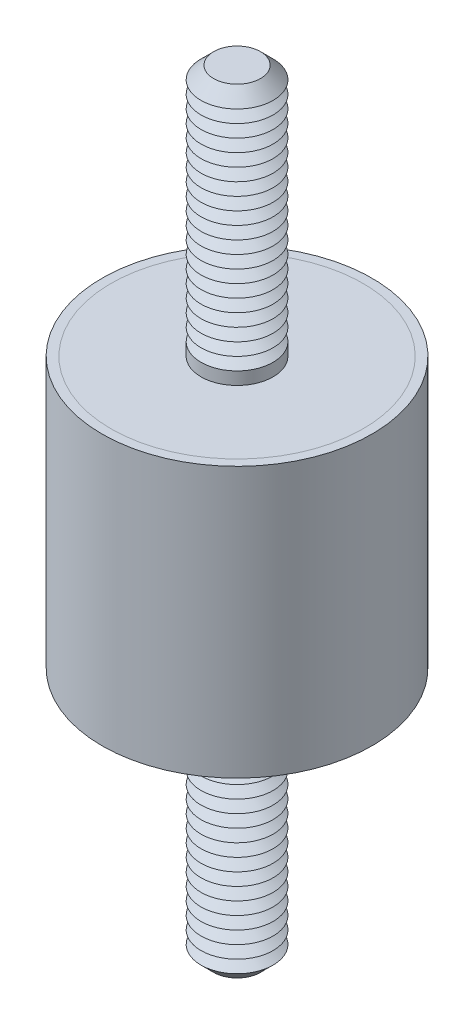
ISO-10303-21;
HEADER;
FILE_DESCRIPTION(('STEP AP214'),'2;1');
FILE_NAME('part.step','',(''),(''),'','','');
FILE_SCHEMA(('AUTOMOTIVE_DESIGN { 1 0 10303 214 1 1 1 1 }'));
ENDSEC;
DATA;
#1=APPLICATION_CONTEXT('core data for automotive mechanical design processes');
#2=APPLICATION_PROTOCOL_DEFINITION('international standard','automotive_design',2000,#1);
#3=PRODUCT_CONTEXT('',#1,'mechanical');
#4=PRODUCT('Part','Part','',(#3));
#5=PRODUCT_RELATED_PRODUCT_CATEGORY('part','',(#4));
#6=PRODUCT_DEFINITION_FORMATION('','',#4);
#7=PRODUCT_DEFINITION_CONTEXT('part definition',#1,'design');
#8=PRODUCT_DEFINITION('design','',#6,#7);
#9=PRODUCT_DEFINITION_SHAPE('','',#8);
#10=(LENGTH_UNIT() NAMED_UNIT(*) SI_UNIT(.MILLI.,.METRE.));
#11=(NAMED_UNIT(*) PLANE_ANGLE_UNIT() SI_UNIT($,.RADIAN.));
#12=(NAMED_UNIT(*) SI_UNIT($,.STERADIAN.) SOLID_ANGLE_UNIT());
#13=UNCERTAINTY_MEASURE_WITH_UNIT(LENGTH_MEASURE(1.E-05),#10,'distance_accuracy_value','');
#14=(GEOMETRIC_REPRESENTATION_CONTEXT(3) GLOBAL_UNCERTAINTY_ASSIGNED_CONTEXT((#13)) GLOBAL_UNIT_ASSIGNED_CONTEXT((#10,
#11,#12)) REPRESENTATION_CONTEXT('',''));
#15=CARTESIAN_POINT('',(0.,0.,0.));
#16=DIRECTION('',(0.,0.,1.));
#17=DIRECTION('',(1.,0.,0.));
#18=AXIS2_PLACEMENT_3D('',#15,#16,#17);
#19=CARTESIAN_POINT('',(0.,-21.5,0.));
#20=DIRECTION('',(0.,1.,0.));
#21=DIRECTION('',(0.,0.,1.));
#22=AXIS2_PLACEMENT_3D('',#19,#20,#21);
#23=CYLINDRICAL_SURFACE('',#22,2.);
#24=CARTESIAN_POINT('',(0.,-7.5,0.));
#25=DIRECTION('',(0.,-1.,0.));
#26=DIRECTION('',(0.,0.,-1.));
#27=AXIS2_PLACEMENT_3D('',#24,#25,#26);
#28=CIRCLE('',#27,2.);
#29=CARTESIAN_POINT('',(0.,-7.5,-2.));
#30=VERTEX_POINT('',#29);
#31=EDGE_CURVE('P0_E21',#30,#30,#28,.T.);
#32=ORIENTED_EDGE('',*,*,#31,.T.);
#33=EDGE_LOOP('',(#32));
#34=FACE_BOUND('',#33,.T.);
#35=CARTESIAN_POINT('',(0.,-8.2,0.));
#36=DIRECTION('',(0.,1.,0.));
#37=DIRECTION('',(0.,0.,1.));
#38=AXIS2_PLACEMENT_3D('',#35,#36,#37);
#39=CIRCLE('',#38,2.);
#40=CARTESIAN_POINT('',(0.,-8.2,2.));
#41=VERTEX_POINT('',#40);
#42=EDGE_CURVE('P0_E33',#41,#41,#39,.T.);
#43=ORIENTED_EDGE('',*,*,#42,.T.);
#44=EDGE_LOOP('',(#43));
#45=FACE_BOUND('',#44,.T.);
#46=ADVANCED_FACE('P0_F14',(#34,#45),#23,.T.);
#47=CARTESIAN_POINT('',(0.,-7.5,0.));
#48=DIRECTION('',(0.,1.,0.));
#49=DIRECTION('',(0.,0.,1.));
#50=AXIS2_PLACEMENT_3D('',#47,#48,#49);
#51=CYLINDRICAL_SURFACE('',#50,7.);
#52=CARTESIAN_POINT('',(0.,-7.5,0.));
#53=DIRECTION('',(0.,1.,0.));
#54=DIRECTION('',(0.,0.,1.));
#55=AXIS2_PLACEMENT_3D('',#52,#53,#54);
#56=CIRCLE('',#55,7.);
#57=CARTESIAN_POINT('',(0.,-7.5,7.));
#58=VERTEX_POINT('',#57);
#59=EDGE_CURVE('P0_E25',#58,#58,#56,.T.);
#60=ORIENTED_EDGE('',*,*,#59,.T.);
#61=EDGE_LOOP('',(#60));
#62=FACE_BOUND('',#61,.T.);
#63=CARTESIAN_POINT('',(0.,-7.,0.));
#64=DIRECTION('',(0.,1.,0.));
#65=DIRECTION('',(0.,0.,1.));
#66=AXIS2_PLACEMENT_3D('',#63,#64,#65);
#67=CIRCLE('',#66,7.);
#68=CARTESIAN_POINT('',(0.,-7.,7.));
#69=VERTEX_POINT('',#68);
#70=EDGE_CURVE('P0_E30',#69,#69,#67,.T.);
#71=ORIENTED_EDGE('',*,*,#70,.F.);
#72=EDGE_LOOP('',(#71));
#73=FACE_BOUND('',#72,.T.);
#74=ADVANCED_FACE('P0_F169',(#62,#73),#51,.T.);
#75=CARTESIAN_POINT('',(0.,-7.5,0.));
#76=DIRECTION('',(0.,1.,0.));
#77=DIRECTION('',(0.,0.,1.));
#78=AXIS2_PLACEMENT_3D('',#75,#76,#77);
#79=PLANE('',#78);
#80=ORIENTED_EDGE('',*,*,#31,.F.);
#81=EDGE_LOOP('',(#80));
#82=FACE_BOUND('',#81,.T.);
#83=ORIENTED_EDGE('',*,*,#59,.F.);
#84=EDGE_LOOP('',(#83));
#85=FACE_BOUND('',#84,.T.);
#86=ADVANCED_FACE('P0_F174',(#82,#85),#79,.F.);
#87=CARTESIAN_POINT('',(0.,-7.,0.));
#88=DIRECTION('',(0.,1.,0.));
#89=DIRECTION('',(0.,0.,1.));
#90=AXIS2_PLACEMENT_3D('',#87,#88,#89);
#91=PLANE('',#90);
#92=ORIENTED_EDGE('',*,*,#70,.T.);
#93=EDGE_LOOP('',(#92));
#94=FACE_BOUND('',#93,.T.);
#95=ADVANCED_FACE('P0_F180',(#94),#91,.T.);
#96=CARTESIAN_POINT('',(0.,-8.2,0.));
#97=DIRECTION('',(0.,1.,0.));
#98=DIRECTION('',(0.,0.,1.));
#99=AXIS2_PLACEMENT_3D('',#96,#97,#98);
#100=CONICAL_SURFACE('',#99,2.,1.0471975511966);
#101=CARTESIAN_POINT('',(0.,-8.55,0.));
#102=DIRECTION('',(0.,1.,0.));
#103=DIRECTION('',(0.,0.,1.));
#104=AXIS2_PLACEMENT_3D('',#101,#102,#103);
#105=CIRCLE('',#104,1.39378221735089);
#106=CARTESIAN_POINT('',(0.,-8.55,1.39378221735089));
#107=VERTEX_POINT('',#106);
#108=EDGE_CURVE('P0_E39',#107,#107,#105,.T.);
#109=ORIENTED_EDGE('',*,*,#108,.T.);
#110=EDGE_LOOP('',(#109));
#111=FACE_BOUND('',#110,.T.);
#112=ORIENTED_EDGE('',*,*,#42,.F.);
#113=EDGE_LOOP('',(#112));
#114=FACE_BOUND('',#113,.T.);
#115=ADVANCED_FACE('P0_F183',(#111,#114),#100,.T.);
#116=CARTESIAN_POINT('',(0.,-8.55,0.));
#117=DIRECTION('',(0.,-1.,0.));
#118=DIRECTION('',(0.,0.,-1.));
#119=AXIS2_PLACEMENT_3D('',#116,#117,#118);
#120=CONICAL_SURFACE('',#119,1.39378221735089,1.0471975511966);
#121=CARTESIAN_POINT('',(0.,-8.9,0.));
#122=DIRECTION('',(0.,1.,0.));
#123=DIRECTION('',(0.,0.,1.));
#124=AXIS2_PLACEMENT_3D('',#121,#122,#123);
#125=CIRCLE('',#124,2.);
#126=CARTESIAN_POINT('',(0.,-8.9,2.));
#127=VERTEX_POINT('',#126);
#128=EDGE_CURVE('P0_E43',#127,#127,#125,.T.);
#129=ORIENTED_EDGE('',*,*,#128,.T.);
#130=EDGE_LOOP('',(#129));
#131=FACE_BOUND('',#130,.T.);
#132=ORIENTED_EDGE('',*,*,#108,.F.);
#133=EDGE_LOOP('',(#132));
#134=FACE_BOUND('',#133,.T.);
#135=ADVANCED_FACE('P0_F187',(#131,#134),#120,.T.);
#136=CARTESIAN_POINT('',(0.,-8.9,0.));
#137=DIRECTION('',(0.,1.,0.));
#138=DIRECTION('',(0.,0.,1.));
#139=AXIS2_PLACEMENT_3D('',#136,#137,#138);
#140=CONICAL_SURFACE('',#139,2.,1.0471975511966);
#141=CARTESIAN_POINT('',(0.,-9.25,0.));
#142=DIRECTION('',(0.,1.,0.));
#143=DIRECTION('',(0.,0.,1.));
#144=AXIS2_PLACEMENT_3D('',#141,#142,#143);
#145=CIRCLE('',#144,1.39378221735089);
#146=CARTESIAN_POINT('',(0.,-9.25,1.39378221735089));
#147=VERTEX_POINT('',#146);
#148=EDGE_CURVE('P0_E47',#147,#147,#145,.T.);
#149=ORIENTED_EDGE('',*,*,#148,.T.);
#150=EDGE_LOOP('',(#149));
#151=FACE_BOUND('',#150,.T.);
#152=ORIENTED_EDGE('',*,*,#128,.F.);
#153=EDGE_LOOP('',(#152));
#154=FACE_BOUND('',#153,.T.);
#155=ADVANCED_FACE('P0_F191',(#151,#154),#140,.T.);
#156=CARTESIAN_POINT('',(0.,-9.25,0.));
#157=DIRECTION('',(0.,-1.,0.));
#158=DIRECTION('',(0.,0.,-1.));
#159=AXIS2_PLACEMENT_3D('',#156,#157,#158);
#160=CONICAL_SURFACE('',#159,1.39378221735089,1.0471975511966);
#161=CARTESIAN_POINT('',(0.,-9.6,0.));
#162=DIRECTION('',(0.,1.,0.));
#163=DIRECTION('',(0.,0.,1.));
#164=AXIS2_PLACEMENT_3D('',#161,#162,#163);
#165=CIRCLE('',#164,2.);
#166=CARTESIAN_POINT('',(0.,-9.6,2.));
#167=VERTEX_POINT('',#166);
#168=EDGE_CURVE('P0_E52',#167,#167,#165,.T.);
#169=ORIENTED_EDGE('',*,*,#168,.T.);
#170=EDGE_LOOP('',(#169));
#171=FACE_BOUND('',#170,.T.);
#172=ORIENTED_EDGE('',*,*,#148,.F.);
#173=EDGE_LOOP('',(#172));
#174=FACE_BOUND('',#173,.T.);
#175=ADVANCED_FACE('P0_F198',(#171,#174),#160,.T.);
#176=CARTESIAN_POINT('',(0.,-9.6,0.));
#177=DIRECTION('',(0.,1.,0.));
#178=DIRECTION('',(0.,0.,1.));
#179=AXIS2_PLACEMENT_3D('',#176,#177,#178);
#180=CONICAL_SURFACE('',#179,2.,1.0471975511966);
#181=CARTESIAN_POINT('',(0.,-9.95,0.));
#182=DIRECTION('',(0.,1.,0.));
#183=DIRECTION('',(0.,0.,1.));
#184=AXIS2_PLACEMENT_3D('',#181,#182,#183);
#185=CIRCLE('',#184,1.39378221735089);
#186=CARTESIAN_POINT('',(0.,-9.95,1.39378221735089));
#187=VERTEX_POINT('',#186);
#188=EDGE_CURVE('P0_E55',#187,#187,#185,.T.);
#189=ORIENTED_EDGE('',*,*,#188,.T.);
#190=EDGE_LOOP('',(#189));
#191=FACE_BOUND('',#190,.T.);
#192=ORIENTED_EDGE('',*,*,#168,.F.);
#193=EDGE_LOOP('',(#192));
#194=FACE_BOUND('',#193,.T.);
#195=ADVANCED_FACE('P0_F202',(#191,#194),#180,.T.);
#196=CARTESIAN_POINT('',(0.,-9.95,0.));
#197=DIRECTION('',(0.,-1.,0.));
#198=DIRECTION('',(0.,0.,-1.));
#199=AXIS2_PLACEMENT_3D('',#196,#197,#198);
#200=CONICAL_SURFACE('',#199,1.39378221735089,1.0471975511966);
#201=CARTESIAN_POINT('',(0.,-10.3,0.));
#202=DIRECTION('',(0.,1.,0.));
#203=DIRECTION('',(0.,0.,1.));
#204=AXIS2_PLACEMENT_3D('',#201,#202,#203);
#205=CIRCLE('',#204,2.);
#206=CARTESIAN_POINT('',(0.,-10.3,2.));
#207=VERTEX_POINT('',#206);
#208=EDGE_CURVE('P0_E58',#207,#207,#205,.T.);
#209=ORIENTED_EDGE('',*,*,#208,.T.);
#210=EDGE_LOOP('',(#209));
#211=FACE_BOUND('',#210,.T.);
#212=ORIENTED_EDGE('',*,*,#188,.F.);
#213=EDGE_LOOP('',(#212));
#214=FACE_BOUND('',#213,.T.);
#215=ADVANCED_FACE('P0_F206',(#211,#214),#200,.T.);
#216=CARTESIAN_POINT('',(0.,-10.3,0.));
#217=DIRECTION('',(0.,1.,0.));
#218=DIRECTION('',(0.,0.,1.));
#219=AXIS2_PLACEMENT_3D('',#216,#217,#218);
#220=CONICAL_SURFACE('',#219,2.,1.0471975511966);
#221=CARTESIAN_POINT('',(0.,-10.65,0.));
#222=DIRECTION('',(0.,1.,0.));
#223=DIRECTION('',(0.,0.,1.));
#224=AXIS2_PLACEMENT_3D('',#221,#222,#223);
#225=CIRCLE('',#224,1.39378221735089);
#226=CARTESIAN_POINT('',(0.,-10.65,1.39378221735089));
#227=VERTEX_POINT('',#226);
#228=EDGE_CURVE('P0_E61',#227,#227,#225,.T.);
#229=ORIENTED_EDGE('',*,*,#228,.T.);
#230=EDGE_LOOP('',(#229));
#231=FACE_BOUND('',#230,.T.);
#232=ORIENTED_EDGE('',*,*,#208,.F.);
#233=EDGE_LOOP('',(#232));
#234=FACE_BOUND('',#233,.T.);
#235=ADVANCED_FACE('P0_F210',(#231,#234),#220,.T.);
#236=CARTESIAN_POINT('',(0.,-10.65,0.));
#237=DIRECTION('',(0.,-1.,0.));
#238=DIRECTION('',(0.,0.,-1.));
#239=AXIS2_PLACEMENT_3D('',#236,#237,#238);
#240=CONICAL_SURFACE('',#239,1.39378221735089,1.0471975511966);
#241=CARTESIAN_POINT('',(0.,-11.,0.));
#242=DIRECTION('',(0.,1.,0.));
#243=DIRECTION('',(0.,0.,1.));
#244=AXIS2_PLACEMENT_3D('',#241,#242,#243);
#245=CIRCLE('',#244,2.);
#246=CARTESIAN_POINT('',(0.,-11.,2.));
#247=VERTEX_POINT('',#246);
#248=EDGE_CURVE('P0_E64',#247,#247,#245,.T.);
#249=ORIENTED_EDGE('',*,*,#248,.T.);
#250=EDGE_LOOP('',(#249));
#251=FACE_BOUND('',#250,.T.);
#252=ORIENTED_EDGE('',*,*,#228,.F.);
#253=EDGE_LOOP('',(#252));
#254=FACE_BOUND('',#253,.T.);
#255=ADVANCED_FACE('P0_F214',(#251,#254),#240,.T.);
#256=CARTESIAN_POINT('',(0.,-11.,0.));
#257=DIRECTION('',(0.,1.,0.));
#258=DIRECTION('',(0.,0.,1.));
#259=AXIS2_PLACEMENT_3D('',#256,#257,#258);
#260=CONICAL_SURFACE('',#259,2.,1.0471975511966);
#261=CARTESIAN_POINT('',(0.,-11.35,0.));
#262=DIRECTION('',(0.,1.,0.));
#263=DIRECTION('',(0.,0.,1.));
#264=AXIS2_PLACEMENT_3D('',#261,#262,#263);
#265=CIRCLE('',#264,1.39378221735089);
#266=CARTESIAN_POINT('',(0.,-11.35,1.39378221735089));
#267=VERTEX_POINT('',#266);
#268=EDGE_CURVE('P0_E67',#267,#267,#265,.T.);
#269=ORIENTED_EDGE('',*,*,#268,.T.);
#270=EDGE_LOOP('',(#269));
#271=FACE_BOUND('',#270,.T.);
#272=ORIENTED_EDGE('',*,*,#248,.F.);
#273=EDGE_LOOP('',(#272));
#274=FACE_BOUND('',#273,.T.);
#275=ADVANCED_FACE('P0_F218',(#271,#274),#260,.T.);
#276=CARTESIAN_POINT('',(0.,-11.35,0.));
#277=DIRECTION('',(0.,-1.,0.));
#278=DIRECTION('',(0.,0.,-1.));
#279=AXIS2_PLACEMENT_3D('',#276,#277,#278);
#280=CONICAL_SURFACE('',#279,1.39378221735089,1.0471975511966);
#281=CARTESIAN_POINT('',(0.,-11.7,0.));
#282=DIRECTION('',(0.,1.,0.));
#283=DIRECTION('',(0.,0.,1.));
#284=AXIS2_PLACEMENT_3D('',#281,#282,#283);
#285=CIRCLE('',#284,2.);
#286=CARTESIAN_POINT('',(0.,-11.7,2.));
#287=VERTEX_POINT('',#286);
#288=EDGE_CURVE('P0_E70',#287,#287,#285,.T.);
#289=ORIENTED_EDGE('',*,*,#288,.T.);
#290=EDGE_LOOP('',(#289));
#291=FACE_BOUND('',#290,.T.);
#292=ORIENTED_EDGE('',*,*,#268,.F.);
#293=EDGE_LOOP('',(#292));
#294=FACE_BOUND('',#293,.T.);
#295=ADVANCED_FACE('P0_F222',(#291,#294),#280,.T.);
#296=CARTESIAN_POINT('',(0.,-11.7,0.));
#297=DIRECTION('',(0.,1.,0.));
#298=DIRECTION('',(0.,0.,1.));
#299=AXIS2_PLACEMENT_3D('',#296,#297,#298);
#300=CONICAL_SURFACE('',#299,2.,1.0471975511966);
#301=CARTESIAN_POINT('',(0.,-12.05,0.));
#302=DIRECTION('',(0.,1.,0.));
#303=DIRECTION('',(0.,0.,1.));
#304=AXIS2_PLACEMENT_3D('',#301,#302,#303);
#305=CIRCLE('',#304,1.39378221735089);
#306=CARTESIAN_POINT('',(0.,-12.05,1.39378221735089));
#307=VERTEX_POINT('',#306);
#308=EDGE_CURVE('P0_E73',#307,#307,#305,.T.);
#309=ORIENTED_EDGE('',*,*,#308,.T.);
#310=EDGE_LOOP('',(#309));
#311=FACE_BOUND('',#310,.T.);
#312=ORIENTED_EDGE('',*,*,#288,.F.);
#313=EDGE_LOOP('',(#312));
#314=FACE_BOUND('',#313,.T.);
#315=ADVANCED_FACE('P0_F226',(#311,#314),#300,.T.);
#316=CARTESIAN_POINT('',(0.,-12.05,0.));
#317=DIRECTION('',(0.,-1.,0.));
#318=DIRECTION('',(0.,0.,-1.));
#319=AXIS2_PLACEMENT_3D('',#316,#317,#318);
#320=CONICAL_SURFACE('',#319,1.39378221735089,1.0471975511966);
#321=CARTESIAN_POINT('',(0.,-12.4,0.));
#322=DIRECTION('',(0.,1.,0.));
#323=DIRECTION('',(0.,0.,1.));
#324=AXIS2_PLACEMENT_3D('',#321,#322,#323);
#325=CIRCLE('',#324,2.);
#326=CARTESIAN_POINT('',(0.,-12.4,2.));
#327=VERTEX_POINT('',#326);
#328=EDGE_CURVE('P0_E76',#327,#327,#325,.T.);
#329=ORIENTED_EDGE('',*,*,#328,.T.);
#330=EDGE_LOOP('',(#329));
#331=FACE_BOUND('',#330,.T.);
#332=ORIENTED_EDGE('',*,*,#308,.F.);
#333=EDGE_LOOP('',(#332));
#334=FACE_BOUND('',#333,.T.);
#335=ADVANCED_FACE('P0_F230',(#331,#334),#320,.T.);
#336=CARTESIAN_POINT('',(0.,-12.4,0.));
#337=DIRECTION('',(0.,1.,0.));
#338=DIRECTION('',(0.,0.,1.));
#339=AXIS2_PLACEMENT_3D('',#336,#337,#338);
#340=CONICAL_SURFACE('',#339,2.,1.0471975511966);
#341=CARTESIAN_POINT('',(0.,-12.75,0.));
#342=DIRECTION('',(0.,1.,0.));
#343=DIRECTION('',(0.,0.,1.));
#344=AXIS2_PLACEMENT_3D('',#341,#342,#343);
#345=CIRCLE('',#344,1.39378221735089);
#346=CARTESIAN_POINT('',(0.,-12.75,1.39378221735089));
#347=VERTEX_POINT('',#346);
#348=EDGE_CURVE('P0_E79',#347,#347,#345,.T.);
#349=ORIENTED_EDGE('',*,*,#348,.T.);
#350=EDGE_LOOP('',(#349));
#351=FACE_BOUND('',#350,.T.);
#352=ORIENTED_EDGE('',*,*,#328,.F.);
#353=EDGE_LOOP('',(#352));
#354=FACE_BOUND('',#353,.T.);
#355=ADVANCED_FACE('P0_F234',(#351,#354),#340,.T.);
#356=CARTESIAN_POINT('',(0.,-12.75,0.));
#357=DIRECTION('',(0.,-1.,0.));
#358=DIRECTION('',(0.,0.,-1.));
#359=AXIS2_PLACEMENT_3D('',#356,#357,#358);
#360=CONICAL_SURFACE('',#359,1.39378221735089,1.0471975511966);
#361=CARTESIAN_POINT('',(0.,-13.1,0.));
#362=DIRECTION('',(0.,1.,0.));
#363=DIRECTION('',(0.,0.,1.));
#364=AXIS2_PLACEMENT_3D('',#361,#362,#363);
#365=CIRCLE('',#364,2.);
#366=CARTESIAN_POINT('',(0.,-13.1,2.));
#367=VERTEX_POINT('',#366);
#368=EDGE_CURVE('P0_E82',#367,#367,#365,.T.);
#369=ORIENTED_EDGE('',*,*,#368,.T.);
#370=EDGE_LOOP('',(#369));
#371=FACE_BOUND('',#370,.T.);
#372=ORIENTED_EDGE('',*,*,#348,.F.);
#373=EDGE_LOOP('',(#372));
#374=FACE_BOUND('',#373,.T.);
#375=ADVANCED_FACE('P0_F238',(#371,#374),#360,.T.);
#376=CARTESIAN_POINT('',(0.,-13.1,0.));
#377=DIRECTION('',(0.,1.,0.));
#378=DIRECTION('',(0.,0.,1.));
#379=AXIS2_PLACEMENT_3D('',#376,#377,#378);
#380=CONICAL_SURFACE('',#379,2.,1.0471975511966);
#381=CARTESIAN_POINT('',(0.,-13.45,0.));
#382=DIRECTION('',(0.,1.,0.));
#383=DIRECTION('',(0.,0.,1.));
#384=AXIS2_PLACEMENT_3D('',#381,#382,#383);
#385=CIRCLE('',#384,1.39378221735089);
#386=CARTESIAN_POINT('',(0.,-13.45,1.39378221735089));
#387=VERTEX_POINT('',#386);
#388=EDGE_CURVE('P0_E85',#387,#387,#385,.T.);
#389=ORIENTED_EDGE('',*,*,#388,.T.);
#390=EDGE_LOOP('',(#389));
#391=FACE_BOUND('',#390,.T.);
#392=ORIENTED_EDGE('',*,*,#368,.F.);
#393=EDGE_LOOP('',(#392));
#394=FACE_BOUND('',#393,.T.);
#395=ADVANCED_FACE('P0_F242',(#391,#394),#380,.T.);
#396=CARTESIAN_POINT('',(0.,-13.45,0.));
#397=DIRECTION('',(0.,-1.,0.));
#398=DIRECTION('',(0.,0.,-1.));
#399=AXIS2_PLACEMENT_3D('',#396,#397,#398);
#400=CONICAL_SURFACE('',#399,1.39378221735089,1.0471975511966);
#401=CARTESIAN_POINT('',(0.,-13.8,0.));
#402=DIRECTION('',(0.,1.,0.));
#403=DIRECTION('',(0.,0.,1.));
#404=AXIS2_PLACEMENT_3D('',#401,#402,#403);
#405=CIRCLE('',#404,2.);
#406=CARTESIAN_POINT('',(0.,-13.8,2.));
#407=VERTEX_POINT('',#406);
#408=EDGE_CURVE('P0_E88',#407,#407,#405,.T.);
#409=ORIENTED_EDGE('',*,*,#408,.T.);
#410=EDGE_LOOP('',(#409));
#411=FACE_BOUND('',#410,.T.);
#412=ORIENTED_EDGE('',*,*,#388,.F.);
#413=EDGE_LOOP('',(#412));
#414=FACE_BOUND('',#413,.T.);
#415=ADVANCED_FACE('P0_F246',(#411,#414),#400,.T.);
#416=CARTESIAN_POINT('',(0.,-13.8,0.));
#417=DIRECTION('',(0.,1.,0.));
#418=DIRECTION('',(0.,0.,1.));
#419=AXIS2_PLACEMENT_3D('',#416,#417,#418);
#420=CONICAL_SURFACE('',#419,2.,1.0471975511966);
#421=CARTESIAN_POINT('',(0.,-14.15,0.));
#422=DIRECTION('',(0.,1.,0.));
#423=DIRECTION('',(0.,0.,1.));
#424=AXIS2_PLACEMENT_3D('',#421,#422,#423);
#425=CIRCLE('',#424,1.39378221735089);
#426=CARTESIAN_POINT('',(0.,-14.15,1.39378221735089));
#427=VERTEX_POINT('',#426);
#428=EDGE_CURVE('P0_E91',#427,#427,#425,.T.);
#429=ORIENTED_EDGE('',*,*,#428,.T.);
#430=EDGE_LOOP('',(#429));
#431=FACE_BOUND('',#430,.T.);
#432=ORIENTED_EDGE('',*,*,#408,.F.);
#433=EDGE_LOOP('',(#432));
#434=FACE_BOUND('',#433,.T.);
#435=ADVANCED_FACE('P0_F250',(#431,#434),#420,.T.);
#436=CARTESIAN_POINT('',(0.,-14.15,0.));
#437=DIRECTION('',(0.,-1.,0.));
#438=DIRECTION('',(0.,0.,-1.));
#439=AXIS2_PLACEMENT_3D('',#436,#437,#438);
#440=CONICAL_SURFACE('',#439,1.39378221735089,1.0471975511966);
#441=CARTESIAN_POINT('',(0.,-14.5,0.));
#442=DIRECTION('',(0.,1.,0.));
#443=DIRECTION('',(0.,0.,1.));
#444=AXIS2_PLACEMENT_3D('',#441,#442,#443);
#445=CIRCLE('',#444,2.);
#446=CARTESIAN_POINT('',(0.,-14.5,2.));
#447=VERTEX_POINT('',#446);
#448=EDGE_CURVE('P0_E94',#447,#447,#445,.T.);
#449=ORIENTED_EDGE('',*,*,#448,.T.);
#450=EDGE_LOOP('',(#449));
#451=FACE_BOUND('',#450,.T.);
#452=ORIENTED_EDGE('',*,*,#428,.F.);
#453=EDGE_LOOP('',(#452));
#454=FACE_BOUND('',#453,.T.);
#455=ADVANCED_FACE('P0_F254',(#451,#454),#440,.T.);
#456=CARTESIAN_POINT('',(0.,-14.5,0.));
#457=DIRECTION('',(0.,1.,0.));
#458=DIRECTION('',(0.,0.,1.));
#459=AXIS2_PLACEMENT_3D('',#456,#457,#458);
#460=CONICAL_SURFACE('',#459,2.,1.0471975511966);
#461=CARTESIAN_POINT('',(0.,-14.85,0.));
#462=DIRECTION('',(0.,1.,0.));
#463=DIRECTION('',(0.,0.,1.));
#464=AXIS2_PLACEMENT_3D('',#461,#462,#463);
#465=CIRCLE('',#464,1.39378221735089);
#466=CARTESIAN_POINT('',(0.,-14.85,1.39378221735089));
#467=VERTEX_POINT('',#466);
#468=EDGE_CURVE('P0_E97',#467,#467,#465,.T.);
#469=ORIENTED_EDGE('',*,*,#468,.T.);
#470=EDGE_LOOP('',(#469));
#471=FACE_BOUND('',#470,.T.);
#472=ORIENTED_EDGE('',*,*,#448,.F.);
#473=EDGE_LOOP('',(#472));
#474=FACE_BOUND('',#473,.T.);
#475=ADVANCED_FACE('P0_F258',(#471,#474),#460,.T.);
#476=CARTESIAN_POINT('',(0.,-14.85,0.));
#477=DIRECTION('',(0.,-1.,0.));
#478=DIRECTION('',(0.,0.,-1.));
#479=AXIS2_PLACEMENT_3D('',#476,#477,#478);
#480=CONICAL_SURFACE('',#479,1.39378221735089,1.0471975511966);
#481=CARTESIAN_POINT('',(0.,-15.2,0.));
#482=DIRECTION('',(0.,1.,0.));
#483=DIRECTION('',(0.,0.,1.));
#484=AXIS2_PLACEMENT_3D('',#481,#482,#483);
#485=CIRCLE('',#484,2.);
#486=CARTESIAN_POINT('',(0.,-15.2,2.));
#487=VERTEX_POINT('',#486);
#488=EDGE_CURVE('P0_E100',#487,#487,#485,.T.);
#489=ORIENTED_EDGE('',*,*,#488,.T.);
#490=EDGE_LOOP('',(#489));
#491=FACE_BOUND('',#490,.T.);
#492=ORIENTED_EDGE('',*,*,#468,.F.);
#493=EDGE_LOOP('',(#492));
#494=FACE_BOUND('',#493,.T.);
#495=ADVANCED_FACE('P0_F262',(#491,#494),#480,.T.);
#496=CARTESIAN_POINT('',(0.,-15.2,0.));
#497=DIRECTION('',(0.,1.,0.));
#498=DIRECTION('',(0.,0.,1.));
#499=AXIS2_PLACEMENT_3D('',#496,#497,#498);
#500=CONICAL_SURFACE('',#499,2.,1.0471975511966);
#501=CARTESIAN_POINT('',(0.,-15.55,0.));
#502=DIRECTION('',(0.,1.,0.));
#503=DIRECTION('',(0.,0.,1.));
#504=AXIS2_PLACEMENT_3D('',#501,#502,#503);
#505=CIRCLE('',#504,1.39378221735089);
#506=CARTESIAN_POINT('',(0.,-15.55,1.39378221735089));
#507=VERTEX_POINT('',#506);
#508=EDGE_CURVE('P0_E103',#507,#507,#505,.T.);
#509=ORIENTED_EDGE('',*,*,#508,.T.);
#510=EDGE_LOOP('',(#509));
#511=FACE_BOUND('',#510,.T.);
#512=ORIENTED_EDGE('',*,*,#488,.F.);
#513=EDGE_LOOP('',(#512));
#514=FACE_BOUND('',#513,.T.);
#515=ADVANCED_FACE('P0_F266',(#511,#514),#500,.T.);
#516=CARTESIAN_POINT('',(0.,-15.55,0.));
#517=DIRECTION('',(0.,-1.,0.));
#518=DIRECTION('',(0.,0.,-1.));
#519=AXIS2_PLACEMENT_3D('',#516,#517,#518);
#520=CONICAL_SURFACE('',#519,1.39378221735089,1.0471975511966);
#521=CARTESIAN_POINT('',(0.,-15.9,0.));
#522=DIRECTION('',(0.,1.,0.));
#523=DIRECTION('',(0.,0.,1.));
#524=AXIS2_PLACEMENT_3D('',#521,#522,#523);
#525=CIRCLE('',#524,2.);
#526=CARTESIAN_POINT('',(0.,-15.9,2.));
#527=VERTEX_POINT('',#526);
#528=EDGE_CURVE('P0_E106',#527,#527,#525,.T.);
#529=ORIENTED_EDGE('',*,*,#528,.T.);
#530=EDGE_LOOP('',(#529));
#531=FACE_BOUND('',#530,.T.);
#532=ORIENTED_EDGE('',*,*,#508,.F.);
#533=EDGE_LOOP('',(#532));
#534=FACE_BOUND('',#533,.T.);
#535=ADVANCED_FACE('P0_F270',(#531,#534),#520,.T.);
#536=CARTESIAN_POINT('',(0.,-15.9,0.));
#537=DIRECTION('',(0.,1.,0.));
#538=DIRECTION('',(0.,0.,1.));
#539=AXIS2_PLACEMENT_3D('',#536,#537,#538);
#540=CONICAL_SURFACE('',#539,2.,1.0471975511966);
#541=CARTESIAN_POINT('',(0.,-16.25,0.));
#542=DIRECTION('',(0.,1.,0.));
#543=DIRECTION('',(0.,0.,1.));
#544=AXIS2_PLACEMENT_3D('',#541,#542,#543);
#545=CIRCLE('',#544,1.39378221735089);
#546=CARTESIAN_POINT('',(0.,-16.25,1.39378221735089));
#547=VERTEX_POINT('',#546);
#548=EDGE_CURVE('P0_E109',#547,#547,#545,.T.);
#549=ORIENTED_EDGE('',*,*,#548,.T.);
#550=EDGE_LOOP('',(#549));
#551=FACE_BOUND('',#550,.T.);
#552=ORIENTED_EDGE('',*,*,#528,.F.);
#553=EDGE_LOOP('',(#552));
#554=FACE_BOUND('',#553,.T.);
#555=ADVANCED_FACE('P0_F274',(#551,#554),#540,.T.);
#556=CARTESIAN_POINT('',(0.,-16.25,0.));
#557=DIRECTION('',(0.,-1.,0.));
#558=DIRECTION('',(0.,0.,-1.));
#559=AXIS2_PLACEMENT_3D('',#556,#557,#558);
#560=CONICAL_SURFACE('',#559,1.39378221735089,1.0471975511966);
#561=CARTESIAN_POINT('',(0.,-16.6,0.));
#562=DIRECTION('',(0.,1.,0.));
#563=DIRECTION('',(0.,0.,1.));
#564=AXIS2_PLACEMENT_3D('',#561,#562,#563);
#565=CIRCLE('',#564,2.);
#566=CARTESIAN_POINT('',(0.,-16.6,2.));
#567=VERTEX_POINT('',#566);
#568=EDGE_CURVE('P0_E112',#567,#567,#565,.T.);
#569=ORIENTED_EDGE('',*,*,#568,.T.);
#570=EDGE_LOOP('',(#569));
#571=FACE_BOUND('',#570,.T.);
#572=ORIENTED_EDGE('',*,*,#548,.F.);
#573=EDGE_LOOP('',(#572));
#574=FACE_BOUND('',#573,.T.);
#575=ADVANCED_FACE('P0_F278',(#571,#574),#560,.T.);
#576=CARTESIAN_POINT('',(0.,-16.6,0.));
#577=DIRECTION('',(0.,1.,0.));
#578=DIRECTION('',(0.,0.,1.));
#579=AXIS2_PLACEMENT_3D('',#576,#577,#578);
#580=CONICAL_SURFACE('',#579,2.,1.0471975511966);
#581=CARTESIAN_POINT('',(0.,-16.95,0.));
#582=DIRECTION('',(0.,1.,0.));
#583=DIRECTION('',(0.,0.,1.));
#584=AXIS2_PLACEMENT_3D('',#581,#582,#583);
#585=CIRCLE('',#584,1.39378221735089);
#586=CARTESIAN_POINT('',(0.,-16.95,1.39378221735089));
#587=VERTEX_POINT('',#586);
#588=EDGE_CURVE('P0_E115',#587,#587,#585,.T.);
#589=ORIENTED_EDGE('',*,*,#588,.T.);
#590=EDGE_LOOP('',(#589));
#591=FACE_BOUND('',#590,.T.);
#592=ORIENTED_EDGE('',*,*,#568,.F.);
#593=EDGE_LOOP('',(#592));
#594=FACE_BOUND('',#593,.T.);
#595=ADVANCED_FACE('P0_F282',(#591,#594),#580,.T.);
#596=CARTESIAN_POINT('',(0.,-16.95,0.));
#597=DIRECTION('',(0.,-1.,0.));
#598=DIRECTION('',(0.,0.,-1.));
#599=AXIS2_PLACEMENT_3D('',#596,#597,#598);
#600=CONICAL_SURFACE('',#599,1.39378221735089,1.0471975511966);
#601=CARTESIAN_POINT('',(0.,-17.3,0.));
#602=DIRECTION('',(0.,1.,0.));
#603=DIRECTION('',(0.,0.,1.));
#604=AXIS2_PLACEMENT_3D('',#601,#602,#603);
#605=CIRCLE('',#604,2.);
#606=CARTESIAN_POINT('',(0.,-17.3,2.));
#607=VERTEX_POINT('',#606);
#608=EDGE_CURVE('P0_E118',#607,#607,#605,.T.);
#609=ORIENTED_EDGE('',*,*,#608,.T.);
#610=EDGE_LOOP('',(#609));
#611=FACE_BOUND('',#610,.T.);
#612=ORIENTED_EDGE('',*,*,#588,.F.);
#613=EDGE_LOOP('',(#612));
#614=FACE_BOUND('',#613,.T.);
#615=ADVANCED_FACE('P0_F286',(#611,#614),#600,.T.);
#616=CARTESIAN_POINT('',(0.,-17.3,0.));
#617=DIRECTION('',(0.,1.,0.));
#618=DIRECTION('',(0.,0.,1.));
#619=AXIS2_PLACEMENT_3D('',#616,#617,#618);
#620=CONICAL_SURFACE('',#619,2.,1.0471975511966);
#621=CARTESIAN_POINT('',(0.,-17.65,0.));
#622=DIRECTION('',(0.,1.,0.));
#623=DIRECTION('',(0.,0.,1.));
#624=AXIS2_PLACEMENT_3D('',#621,#622,#623);
#625=CIRCLE('',#624,1.39378221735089);
#626=CARTESIAN_POINT('',(0.,-17.65,1.39378221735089));
#627=VERTEX_POINT('',#626);
#628=EDGE_CURVE('P0_E121',#627,#627,#625,.T.);
#629=ORIENTED_EDGE('',*,*,#628,.T.);
#630=EDGE_LOOP('',(#629));
#631=FACE_BOUND('',#630,.T.);
#632=ORIENTED_EDGE('',*,*,#608,.F.);
#633=EDGE_LOOP('',(#632));
#634=FACE_BOUND('',#633,.T.);
#635=ADVANCED_FACE('P0_F290',(#631,#634),#620,.T.);
#636=CARTESIAN_POINT('',(0.,-17.65,0.));
#637=DIRECTION('',(0.,-1.,0.));
#638=DIRECTION('',(0.,0.,-1.));
#639=AXIS2_PLACEMENT_3D('',#636,#637,#638);
#640=CONICAL_SURFACE('',#639,1.39378221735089,1.0471975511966);
#641=CARTESIAN_POINT('',(0.,-18.,0.));
#642=DIRECTION('',(0.,1.,0.));
#643=DIRECTION('',(0.,0.,1.));
#644=AXIS2_PLACEMENT_3D('',#641,#642,#643);
#645=CIRCLE('',#644,2.);
#646=CARTESIAN_POINT('',(0.,-18.,2.));
#647=VERTEX_POINT('',#646);
#648=EDGE_CURVE('P0_E124',#647,#647,#645,.T.);
#649=ORIENTED_EDGE('',*,*,#648,.T.);
#650=EDGE_LOOP('',(#649));
#651=FACE_BOUND('',#650,.T.);
#652=ORIENTED_EDGE('',*,*,#628,.F.);
#653=EDGE_LOOP('',(#652));
#654=FACE_BOUND('',#653,.T.);
#655=ADVANCED_FACE('P0_F294',(#651,#654),#640,.T.);
#656=CARTESIAN_POINT('',(0.,-18.,0.));
#657=DIRECTION('',(0.,1.,0.));
#658=DIRECTION('',(0.,0.,1.));
#659=AXIS2_PLACEMENT_3D('',#656,#657,#658);
#660=CONICAL_SURFACE('',#659,2.,1.0471975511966);
#661=CARTESIAN_POINT('',(0.,-18.35,0.));
#662=DIRECTION('',(0.,1.,0.));
#663=DIRECTION('',(0.,0.,1.));
#664=AXIS2_PLACEMENT_3D('',#661,#662,#663);
#665=CIRCLE('',#664,1.39378221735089);
#666=CARTESIAN_POINT('',(0.,-18.35,1.39378221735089));
#667=VERTEX_POINT('',#666);
#668=EDGE_CURVE('P0_E127',#667,#667,#665,.T.);
#669=ORIENTED_EDGE('',*,*,#668,.T.);
#670=EDGE_LOOP('',(#669));
#671=FACE_BOUND('',#670,.T.);
#672=ORIENTED_EDGE('',*,*,#648,.F.);
#673=EDGE_LOOP('',(#672));
#674=FACE_BOUND('',#673,.T.);
#675=ADVANCED_FACE('P0_F298',(#671,#674),#660,.T.);
#676=CARTESIAN_POINT('',(0.,-18.35,0.));
#677=DIRECTION('',(0.,-1.,0.));
#678=DIRECTION('',(0.,0.,-1.));
#679=AXIS2_PLACEMENT_3D('',#676,#677,#678);
#680=CONICAL_SURFACE('',#679,1.39378221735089,1.0471975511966);
#681=CARTESIAN_POINT('',(0.,-18.7,0.));
#682=DIRECTION('',(0.,1.,0.));
#683=DIRECTION('',(0.,0.,1.));
#684=AXIS2_PLACEMENT_3D('',#681,#682,#683);
#685=CIRCLE('',#684,2.);
#686=CARTESIAN_POINT('',(0.,-18.7,2.));
#687=VERTEX_POINT('',#686);
#688=EDGE_CURVE('P0_E130',#687,#687,#685,.T.);
#689=ORIENTED_EDGE('',*,*,#688,.T.);
#690=EDGE_LOOP('',(#689));
#691=FACE_BOUND('',#690,.T.);
#692=ORIENTED_EDGE('',*,*,#668,.F.);
#693=EDGE_LOOP('',(#692));
#694=FACE_BOUND('',#693,.T.);
#695=ADVANCED_FACE('P0_F302',(#691,#694),#680,.T.);
#696=CARTESIAN_POINT('',(0.,-18.7,0.));
#697=DIRECTION('',(0.,1.,0.));
#698=DIRECTION('',(0.,0.,1.));
#699=AXIS2_PLACEMENT_3D('',#696,#697,#698);
#700=CONICAL_SURFACE('',#699,2.,1.0471975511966);
#701=CARTESIAN_POINT('',(0.,-19.05,0.));
#702=DIRECTION('',(0.,1.,0.));
#703=DIRECTION('',(0.,0.,1.));
#704=AXIS2_PLACEMENT_3D('',#701,#702,#703);
#705=CIRCLE('',#704,1.39378221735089);
#706=CARTESIAN_POINT('',(0.,-19.05,1.39378221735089));
#707=VERTEX_POINT('',#706);
#708=EDGE_CURVE('P0_E133',#707,#707,#705,.T.);
#709=ORIENTED_EDGE('',*,*,#708,.T.);
#710=EDGE_LOOP('',(#709));
#711=FACE_BOUND('',#710,.T.);
#712=ORIENTED_EDGE('',*,*,#688,.F.);
#713=EDGE_LOOP('',(#712));
#714=FACE_BOUND('',#713,.T.);
#715=ADVANCED_FACE('P0_F306',(#711,#714),#700,.T.);
#716=CARTESIAN_POINT('',(0.,-19.05,0.));
#717=DIRECTION('',(0.,-1.,0.));
#718=DIRECTION('',(0.,0.,-1.));
#719=AXIS2_PLACEMENT_3D('',#716,#717,#718);
#720=CONICAL_SURFACE('',#719,1.39378221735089,1.0471975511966);
#721=CARTESIAN_POINT('',(0.,-19.4,0.));
#722=DIRECTION('',(0.,1.,0.));
#723=DIRECTION('',(0.,0.,1.));
#724=AXIS2_PLACEMENT_3D('',#721,#722,#723);
#725=CIRCLE('',#724,2.);
#726=CARTESIAN_POINT('',(0.,-19.4,2.));
#727=VERTEX_POINT('',#726);
#728=EDGE_CURVE('P0_E136',#727,#727,#725,.T.);
#729=ORIENTED_EDGE('',*,*,#728,.T.);
#730=EDGE_LOOP('',(#729));
#731=FACE_BOUND('',#730,.T.);
#732=ORIENTED_EDGE('',*,*,#708,.F.);
#733=EDGE_LOOP('',(#732));
#734=FACE_BOUND('',#733,.T.);
#735=ADVANCED_FACE('P0_F310',(#731,#734),#720,.T.);
#736=CARTESIAN_POINT('',(0.,-19.4,0.));
#737=DIRECTION('',(0.,1.,0.));
#738=DIRECTION('',(0.,0.,1.));
#739=AXIS2_PLACEMENT_3D('',#736,#737,#738);
#740=CONICAL_SURFACE('',#739,2.,1.0471975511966);
#741=CARTESIAN_POINT('',(0.,-19.75,0.));
#742=DIRECTION('',(0.,1.,0.));
#743=DIRECTION('',(0.,0.,1.));
#744=AXIS2_PLACEMENT_3D('',#741,#742,#743);
#745=CIRCLE('',#744,1.39378221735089);
#746=CARTESIAN_POINT('',(0.,-19.75,1.39378221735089));
#747=VERTEX_POINT('',#746);
#748=EDGE_CURVE('P0_E139',#747,#747,#745,.T.);
#749=ORIENTED_EDGE('',*,*,#748,.T.);
#750=EDGE_LOOP('',(#749));
#751=FACE_BOUND('',#750,.T.);
#752=ORIENTED_EDGE('',*,*,#728,.F.);
#753=EDGE_LOOP('',(#752));
#754=FACE_BOUND('',#753,.T.);
#755=ADVANCED_FACE('P0_F314',(#751,#754),#740,.T.);
#756=CARTESIAN_POINT('',(0.,-19.75,0.));
#757=DIRECTION('',(0.,-1.,0.));
#758=DIRECTION('',(0.,0.,-1.));
#759=AXIS2_PLACEMENT_3D('',#756,#757,#758);
#760=CONICAL_SURFACE('',#759,1.39378221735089,1.0471975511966);
#761=CARTESIAN_POINT('',(0.,-20.1,0.));
#762=DIRECTION('',(0.,1.,0.));
#763=DIRECTION('',(0.,0.,1.));
#764=AXIS2_PLACEMENT_3D('',#761,#762,#763);
#765=CIRCLE('',#764,2.);
#766=CARTESIAN_POINT('',(0.,-20.1,2.));
#767=VERTEX_POINT('',#766);
#768=EDGE_CURVE('P0_E142',#767,#767,#765,.T.);
#769=ORIENTED_EDGE('',*,*,#768,.T.);
#770=EDGE_LOOP('',(#769));
#771=FACE_BOUND('',#770,.T.);
#772=ORIENTED_EDGE('',*,*,#748,.F.);
#773=EDGE_LOOP('',(#772));
#774=FACE_BOUND('',#773,.T.);
#775=ADVANCED_FACE('P0_F166',(#771,#774),#760,.T.);
#776=CARTESIAN_POINT('',(0.,-20.1,0.));
#777=DIRECTION('',(0.,1.,0.));
#778=DIRECTION('',(0.,0.,1.));
#779=AXIS2_PLACEMENT_3D('',#776,#777,#778);
#780=CONICAL_SURFACE('',#779,2.,1.0471975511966);
#781=CARTESIAN_POINT('',(0.,-20.45,0.));
#782=DIRECTION('',(0.,1.,0.));
#783=DIRECTION('',(0.,0.,1.));
#784=AXIS2_PLACEMENT_3D('',#781,#782,#783);
#785=CIRCLE('',#784,1.39378221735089);
#786=CARTESIAN_POINT('',(0.,-20.45,1.39378221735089));
#787=VERTEX_POINT('',#786);
#788=EDGE_CURVE('P0_E148',#787,#787,#785,.T.);
#789=ORIENTED_EDGE('',*,*,#788,.T.);
#790=EDGE_LOOP('',(#789));
#791=FACE_BOUND('',#790,.T.);
#792=ORIENTED_EDGE('',*,*,#768,.F.);
#793=EDGE_LOOP('',(#792));
#794=FACE_BOUND('',#793,.T.);
#795=ADVANCED_FACE('P0_F152',(#791,#794),#780,.T.);
#796=CARTESIAN_POINT('',(0.,-20.45,0.));
#797=DIRECTION('',(0.,-1.,0.));
#798=DIRECTION('',(0.,0.,-1.));
#799=AXIS2_PLACEMENT_3D('',#796,#797,#798);
#800=CONICAL_SURFACE('',#799,1.39378221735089,1.0471975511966);
#801=CARTESIAN_POINT('',(0.,-20.8,0.));
#802=DIRECTION('',(0.,1.,0.));
#803=DIRECTION('',(0.,0.,1.));
#804=AXIS2_PLACEMENT_3D('',#801,#802,#803);
#805=CIRCLE('',#804,2.);
#806=CARTESIAN_POINT('',(0.,-20.8,2.));
#807=VERTEX_POINT('',#806);
#808=EDGE_CURVE('P0_E145',#807,#807,#805,.T.);
#809=ORIENTED_EDGE('',*,*,#808,.T.);
#810=EDGE_LOOP('',(#809));
#811=FACE_BOUND('',#810,.T.);
#812=ORIENTED_EDGE('',*,*,#788,.F.);
#813=EDGE_LOOP('',(#812));
#814=FACE_BOUND('',#813,.T.);
#815=ADVANCED_FACE('P0_F155',(#811,#814),#800,.T.);
#816=CARTESIAN_POINT('',(0.,-21.5,0.));
#817=DIRECTION('',(0.,-1.,0.));
#818=DIRECTION('',(0.,0.,-1.));
#819=AXIS2_PLACEMENT_3D('',#816,#817,#818);
#820=PLANE('',#819);
#821=CARTESIAN_POINT('',(0.,-21.5,0.));
#822=DIRECTION('',(0.,-1.,0.));
#823=DIRECTION('',(0.,0.,-1.));
#824=AXIS2_PLACEMENT_3D('',#821,#822,#823);
#825=CIRCLE('',#824,1.3);
#826=CARTESIAN_POINT('',(0.,-21.5,-1.3));
#827=VERTEX_POINT('',#826);
#828=EDGE_CURVE('P0_E10',#827,#827,#825,.T.);
#829=ORIENTED_EDGE('',*,*,#828,.T.);
#830=EDGE_LOOP('',(#829));
#831=FACE_BOUND('',#830,.T.);
#832=ADVANCED_FACE('P0_F157',(#831),#820,.T.);
#833=CARTESIAN_POINT('',(0.,-21.5,0.));
#834=DIRECTION('',(0.,1.,0.));
#835=DIRECTION('',(0.,0.,1.));
#836=AXIS2_PLACEMENT_3D('',#833,#834,#835);
#837=CONICAL_SURFACE('',#836,1.3,0.785398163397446);
#838=ORIENTED_EDGE('',*,*,#808,.F.);
#839=EDGE_LOOP('',(#838));
#840=FACE_BOUND('',#839,.T.);
#841=ORIENTED_EDGE('',*,*,#828,.F.);
#842=EDGE_LOOP('',(#841));
#843=FACE_BOUND('',#842,.T.);
#844=ADVANCED_FACE('P0_F16',(#840,#843),#837,.T.);
#845=CLOSED_SHELL('',(#46,#74,#86,#95,#115,#135,#155,#175,#195,#215,#235,#255,#275,#295,#315,
#335,#355,#375,#395,#415,#435,#455,#475,#495,#515,#535,#555,#575,#595,#615,#635,#655,#675,#695,
#715,#735,#755,#775,#795,#815,#832,#844));
#846=MANIFOLD_SOLID_BREP('P0_B1',#845);
#847=CARTESIAN_POINT('',(0.,21.5,0.));
#848=DIRECTION('',(0.,-1.,0.));
#849=DIRECTION('',(0.,0.,-1.));
#850=AXIS2_PLACEMENT_3D('',#847,#848,#849);
#851=CYLINDRICAL_SURFACE('',#850,2.);
#852=CARTESIAN_POINT('',(0.,8.2,0.));
#853=DIRECTION('',(0.,1.,0.));
#854=DIRECTION('',(0.,0.,1.));
#855=AXIS2_PLACEMENT_3D('',#852,#853,#854);
#856=CIRCLE('',#855,2.);
#857=CARTESIAN_POINT('',(0.,8.2,2.));
#858=VERTEX_POINT('',#857);
#859=EDGE_CURVE('P1_E33',#858,#858,#856,.T.);
#860=ORIENTED_EDGE('',*,*,#859,.F.);
#861=EDGE_LOOP('',(#860));
#862=FACE_BOUND('',#861,.T.);
#863=CARTESIAN_POINT('',(0.,7.5,0.));
#864=DIRECTION('',(0.,1.,0.));
#865=DIRECTION('',(0.,0.,1.));
#866=AXIS2_PLACEMENT_3D('',#863,#864,#865);
#867=CIRCLE('',#866,2.);
#868=CARTESIAN_POINT('',(0.,7.5,2.));
#869=VERTEX_POINT('',#868);
#870=EDGE_CURVE('P1_E21',#869,#869,#867,.T.);
#871=ORIENTED_EDGE('',*,*,#870,.T.);
#872=EDGE_LOOP('',(#871));
#873=FACE_BOUND('',#872,.T.);
#874=ADVANCED_FACE('P1_F14',(#862,#873),#851,.T.);
#875=CARTESIAN_POINT('',(0.,7.5,0.));
#876=DIRECTION('',(0.,-1.,0.));
#877=DIRECTION('',(0.,0.,-1.));
#878=AXIS2_PLACEMENT_3D('',#875,#876,#877);
#879=CYLINDRICAL_SURFACE('',#878,7.);
#880=CARTESIAN_POINT('',(0.,7.5,0.));
#881=DIRECTION('',(0.,1.,0.));
#882=DIRECTION('',(0.,0.,1.));
#883=AXIS2_PLACEMENT_3D('',#880,#881,#882);
#884=CIRCLE('',#883,7.);
#885=CARTESIAN_POINT('',(0.,7.5,7.));
#886=VERTEX_POINT('',#885);
#887=EDGE_CURVE('P1_E25',#886,#886,#884,.T.);
#888=ORIENTED_EDGE('',*,*,#887,.F.);
#889=EDGE_LOOP('',(#888));
#890=FACE_BOUND('',#889,.T.);
#891=CARTESIAN_POINT('',(0.,7.,0.));
#892=DIRECTION('',(0.,1.,0.));
#893=DIRECTION('',(0.,0.,1.));
#894=AXIS2_PLACEMENT_3D('',#891,#892,#893);
#895=CIRCLE('',#894,7.);
#896=CARTESIAN_POINT('',(0.,7.,7.));
#897=VERTEX_POINT('',#896);
#898=EDGE_CURVE('P1_E30',#897,#897,#895,.T.);
#899=ORIENTED_EDGE('',*,*,#898,.T.);
#900=EDGE_LOOP('',(#899));
#901=FACE_BOUND('',#900,.T.);
#902=ADVANCED_FACE('P1_F364',(#890,#901),#879,.T.);
#903=CARTESIAN_POINT('',(0.,7.5,0.));
#904=DIRECTION('',(0.,1.,0.));
#905=DIRECTION('',(0.,0.,1.));
#906=AXIS2_PLACEMENT_3D('',#903,#904,#905);
#907=PLANE('',#906);
#908=ORIENTED_EDGE('',*,*,#870,.F.);
#909=EDGE_LOOP('',(#908));
#910=FACE_BOUND('',#909,.T.);
#911=ORIENTED_EDGE('',*,*,#887,.T.);
#912=EDGE_LOOP('',(#911));
#913=FACE_BOUND('',#912,.T.);
#914=ADVANCED_FACE('P1_F370',(#910,#913),#907,.T.);
#915=CARTESIAN_POINT('',(0.,7.,0.));
#916=DIRECTION('',(0.,1.,0.));
#917=DIRECTION('',(0.,0.,1.));
#918=AXIS2_PLACEMENT_3D('',#915,#916,#917);
#919=PLANE('',#918);
#920=ORIENTED_EDGE('',*,*,#898,.F.);
#921=EDGE_LOOP('',(#920));
#922=FACE_BOUND('',#921,.T.);
#923=ADVANCED_FACE('P1_F360',(#922),#919,.F.);
#924=CARTESIAN_POINT('',(0.,8.2,0.));
#925=DIRECTION('',(0.,-1.,0.));
#926=DIRECTION('',(0.,0.,-1.));
#927=AXIS2_PLACEMENT_3D('',#924,#925,#926);
#928=CONICAL_SURFACE('',#927,2.,1.0471975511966);
#929=CARTESIAN_POINT('',(0.,8.55,0.));
#930=DIRECTION('',(0.,1.,0.));
#931=DIRECTION('',(0.,0.,1.));
#932=AXIS2_PLACEMENT_3D('',#929,#930,#931);
#933=CIRCLE('',#932,1.39378221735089);
#934=CARTESIAN_POINT('',(0.,8.55,1.39378221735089));
#935=VERTEX_POINT('',#934);
#936=EDGE_CURVE('P1_E39',#935,#935,#933,.T.);
#937=ORIENTED_EDGE('',*,*,#936,.F.);
#938=EDGE_LOOP('',(#937));
#939=FACE_BOUND('',#938,.T.);
#940=ORIENTED_EDGE('',*,*,#859,.T.);
#941=EDGE_LOOP('',(#940));
#942=FACE_BOUND('',#941,.T.);
#943=ADVANCED_FACE('P1_F354',(#939,#942),#928,.T.);
#944=CARTESIAN_POINT('',(0.,8.55,0.));
#945=DIRECTION('',(0.,1.,0.));
#946=DIRECTION('',(0.,0.,1.));
#947=AXIS2_PLACEMENT_3D('',#944,#945,#946);
#948=CONICAL_SURFACE('',#947,1.39378221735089,1.0471975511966);
#949=CARTESIAN_POINT('',(0.,8.9,0.));
#950=DIRECTION('',(0.,1.,0.));
#951=DIRECTION('',(0.,0.,1.));
#952=AXIS2_PLACEMENT_3D('',#949,#950,#951);
#953=CIRCLE('',#952,2.);
#954=CARTESIAN_POINT('',(0.,8.9,2.));
#955=VERTEX_POINT('',#954);
#956=EDGE_CURVE('P1_E43',#955,#955,#953,.T.);
#957=ORIENTED_EDGE('',*,*,#956,.F.);
#958=EDGE_LOOP('',(#957));
#959=FACE_BOUND('',#958,.T.);
#960=ORIENTED_EDGE('',*,*,#936,.T.);
#961=EDGE_LOOP('',(#960));
#962=FACE_BOUND('',#961,.T.);
#963=ADVANCED_FACE('P1_F349',(#959,#962),#948,.T.);
#964=CARTESIAN_POINT('',(0.,8.9,0.));
#965=DIRECTION('',(0.,-1.,0.));
#966=DIRECTION('',(0.,0.,-1.));
#967=AXIS2_PLACEMENT_3D('',#964,#965,#966);
#968=CONICAL_SURFACE('',#967,2.,1.0471975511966);
#969=CARTESIAN_POINT('',(0.,9.25,0.));
#970=DIRECTION('',(0.,1.,0.));
#971=DIRECTION('',(0.,0.,1.));
#972=AXIS2_PLACEMENT_3D('',#969,#970,#971);
#973=CIRCLE('',#972,1.39378221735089);
#974=CARTESIAN_POINT('',(0.,9.25,1.39378221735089));
#975=VERTEX_POINT('',#974);
#976=EDGE_CURVE('P1_E47',#975,#975,#973,.T.);
#977=ORIENTED_EDGE('',*,*,#976,.F.);
#978=EDGE_LOOP('',(#977));
#979=FACE_BOUND('',#978,.T.);
#980=ORIENTED_EDGE('',*,*,#956,.T.);
#981=EDGE_LOOP('',(#980));
#982=FACE_BOUND('',#981,.T.);
#983=ADVANCED_FACE('P1_F343',(#979,#982),#968,.T.);
#984=CARTESIAN_POINT('',(0.,9.25,0.));
#985=DIRECTION('',(0.,1.,0.));
#986=DIRECTION('',(0.,0.,1.));
#987=AXIS2_PLACEMENT_3D('',#984,#985,#986);
#988=CONICAL_SURFACE('',#987,1.39378221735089,1.0471975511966);
#989=CARTESIAN_POINT('',(0.,9.6,0.));
#990=DIRECTION('',(0.,1.,0.));
#991=DIRECTION('',(0.,0.,1.));
#992=AXIS2_PLACEMENT_3D('',#989,#990,#991);
#993=CIRCLE('',#992,2.);
#994=CARTESIAN_POINT('',(0.,9.6,2.));
#995=VERTEX_POINT('',#994);
#996=EDGE_CURVE('P1_E52',#995,#995,#993,.T.);
#997=ORIENTED_EDGE('',*,*,#996,.F.);
#998=EDGE_LOOP('',(#997));
#999=FACE_BOUND('',#998,.T.);
#1000=ORIENTED_EDGE('',*,*,#976,.T.);
#1001=EDGE_LOOP('',(#1000));
#1002=FACE_BOUND('',#1001,.T.);
#1003=ADVANCED_FACE('P1_F337',(#999,#1002),#988,.T.);
#1004=CARTESIAN_POINT('',(0.,9.6,0.));
#1005=DIRECTION('',(0.,-1.,0.));
#1006=DIRECTION('',(0.,0.,-1.));
#1007=AXIS2_PLACEMENT_3D('',#1004,#1005,#1006);
#1008=CONICAL_SURFACE('',#1007,2.,1.0471975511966);
#1009=CARTESIAN_POINT('',(0.,9.95,0.));
#1010=DIRECTION('',(0.,1.,0.));
#1011=DIRECTION('',(0.,0.,1.));
#1012=AXIS2_PLACEMENT_3D('',#1009,#1010,#1011);
#1013=CIRCLE('',#1012,1.39378221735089);
#1014=CARTESIAN_POINT('',(0.,9.95,1.39378221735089));
#1015=VERTEX_POINT('',#1014);
#1016=EDGE_CURVE('P1_E55',#1015,#1015,#1013,.T.);
#1017=ORIENTED_EDGE('',*,*,#1016,.F.);
#1018=EDGE_LOOP('',(#1017));
#1019=FACE_BOUND('',#1018,.T.);
#1020=ORIENTED_EDGE('',*,*,#996,.T.);
#1021=EDGE_LOOP('',(#1020));
#1022=FACE_BOUND('',#1021,.T.);
#1023=ADVANCED_FACE('P1_F331',(#1019,#1022),#1008,.T.);
#1024=CARTESIAN_POINT('',(0.,9.95,0.));
#1025=DIRECTION('',(0.,1.,0.));
#1026=DIRECTION('',(0.,0.,1.));
#1027=AXIS2_PLACEMENT_3D('',#1024,#1025,#1026);
#1028=CONICAL_SURFACE('',#1027,1.39378221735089,1.0471975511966);
#1029=CARTESIAN_POINT('',(0.,10.3,0.));
#1030=DIRECTION('',(0.,1.,0.));
#1031=DIRECTION('',(0.,0.,1.));
#1032=AXIS2_PLACEMENT_3D('',#1029,#1030,#1031);
#1033=CIRCLE('',#1032,2.);
#1034=CARTESIAN_POINT('',(0.,10.3,2.));
#1035=VERTEX_POINT('',#1034);
#1036=EDGE_CURVE('P1_E58',#1035,#1035,#1033,.T.);
#1037=ORIENTED_EDGE('',*,*,#1036,.F.);
#1038=EDGE_LOOP('',(#1037));
#1039=FACE_BOUND('',#1038,.T.);
#1040=ORIENTED_EDGE('',*,*,#1016,.T.);
#1041=EDGE_LOOP('',(#1040));
#1042=FACE_BOUND('',#1041,.T.);
#1043=ADVANCED_FACE('P1_F325',(#1039,#1042),#1028,.T.);
#1044=CARTESIAN_POINT('',(0.,10.3,0.));
#1045=DIRECTION('',(0.,-1.,0.));
#1046=DIRECTION('',(0.,0.,-1.));
#1047=AXIS2_PLACEMENT_3D('',#1044,#1045,#1046);
#1048=CONICAL_SURFACE('',#1047,2.,1.0471975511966);
#1049=CARTESIAN_POINT('',(0.,10.65,0.));
#1050=DIRECTION('',(0.,1.,0.));
#1051=DIRECTION('',(0.,0.,1.));
#1052=AXIS2_PLACEMENT_3D('',#1049,#1050,#1051);
#1053=CIRCLE('',#1052,1.39378221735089);
#1054=CARTESIAN_POINT('',(0.,10.65,1.39378221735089));
#1055=VERTEX_POINT('',#1054);
#1056=EDGE_CURVE('P1_E61',#1055,#1055,#1053,.T.);
#1057=ORIENTED_EDGE('',*,*,#1056,.F.);
#1058=EDGE_LOOP('',(#1057));
#1059=FACE_BOUND('',#1058,.T.);
#1060=ORIENTED_EDGE('',*,*,#1036,.T.);
#1061=EDGE_LOOP('',(#1060));
#1062=FACE_BOUND('',#1061,.T.);
#1063=ADVANCED_FACE('P1_F319',(#1059,#1062),#1048,.T.);
#1064=CARTESIAN_POINT('',(0.,10.65,0.));
#1065=DIRECTION('',(0.,1.,0.));
#1066=DIRECTION('',(0.,0.,1.));
#1067=AXIS2_PLACEMENT_3D('',#1064,#1065,#1066);
#1068=CONICAL_SURFACE('',#1067,1.39378221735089,1.0471975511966);
#1069=CARTESIAN_POINT('',(0.,11.,0.));
#1070=DIRECTION('',(0.,1.,0.));
#1071=DIRECTION('',(0.,0.,1.));
#1072=AXIS2_PLACEMENT_3D('',#1069,#1070,#1071);
#1073=CIRCLE('',#1072,2.);
#1074=CARTESIAN_POINT('',(0.,11.,2.));
#1075=VERTEX_POINT('',#1074);
#1076=EDGE_CURVE('P1_E64',#1075,#1075,#1073,.T.);
#1077=ORIENTED_EDGE('',*,*,#1076,.F.);
#1078=EDGE_LOOP('',(#1077));
#1079=FACE_BOUND('',#1078,.T.);
#1080=ORIENTED_EDGE('',*,*,#1056,.T.);
#1081=EDGE_LOOP('',(#1080));
#1082=FACE_BOUND('',#1081,.T.);
#1083=ADVANCED_FACE('P1_F313',(#1079,#1082),#1068,.T.);
#1084=CARTESIAN_POINT('',(0.,11.,0.));
#1085=DIRECTION('',(0.,-1.,0.));
#1086=DIRECTION('',(0.,0.,-1.));
#1087=AXIS2_PLACEMENT_3D('',#1084,#1085,#1086);
#1088=CONICAL_SURFACE('',#1087,2.,1.0471975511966);
#1089=CARTESIAN_POINT('',(0.,11.35,0.));
#1090=DIRECTION('',(0.,1.,0.));
#1091=DIRECTION('',(0.,0.,1.));
#1092=AXIS2_PLACEMENT_3D('',#1089,#1090,#1091);
#1093=CIRCLE('',#1092,1.39378221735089);
#1094=CARTESIAN_POINT('',(0.,11.35,1.39378221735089));
#1095=VERTEX_POINT('',#1094);
#1096=EDGE_CURVE('P1_E67',#1095,#1095,#1093,.T.);
#1097=ORIENTED_EDGE('',*,*,#1096,.F.);
#1098=EDGE_LOOP('',(#1097));
#1099=FACE_BOUND('',#1098,.T.);
#1100=ORIENTED_EDGE('',*,*,#1076,.T.);
#1101=EDGE_LOOP('',(#1100));
#1102=FACE_BOUND('',#1101,.T.);
#1103=ADVANCED_FACE('P1_F307',(#1099,#1102),#1088,.T.);
#1104=CARTESIAN_POINT('',(0.,11.35,0.));
#1105=DIRECTION('',(0.,1.,0.));
#1106=DIRECTION('',(0.,0.,1.));
#1107=AXIS2_PLACEMENT_3D('',#1104,#1105,#1106);
#1108=CONICAL_SURFACE('',#1107,1.39378221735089,1.0471975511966);
#1109=CARTESIAN_POINT('',(0.,11.7,0.));
#1110=DIRECTION('',(0.,1.,0.));
#1111=DIRECTION('',(0.,0.,1.));
#1112=AXIS2_PLACEMENT_3D('',#1109,#1110,#1111);
#1113=CIRCLE('',#1112,2.);
#1114=CARTESIAN_POINT('',(0.,11.7,2.));
#1115=VERTEX_POINT('',#1114);
#1116=EDGE_CURVE('P1_E70',#1115,#1115,#1113,.T.);
#1117=ORIENTED_EDGE('',*,*,#1116,.F.);
#1118=EDGE_LOOP('',(#1117));
#1119=FACE_BOUND('',#1118,.T.);
#1120=ORIENTED_EDGE('',*,*,#1096,.T.);
#1121=EDGE_LOOP('',(#1120));
#1122=FACE_BOUND('',#1121,.T.);
#1123=ADVANCED_FACE('P1_F301',(#1119,#1122),#1108,.T.);
#1124=CARTESIAN_POINT('',(0.,11.7,0.));
#1125=DIRECTION('',(0.,-1.,0.));
#1126=DIRECTION('',(0.,0.,-1.));
#1127=AXIS2_PLACEMENT_3D('',#1124,#1125,#1126);
#1128=CONICAL_SURFACE('',#1127,2.,1.0471975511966);
#1129=CARTESIAN_POINT('',(0.,12.05,0.));
#1130=DIRECTION('',(0.,1.,0.));
#1131=DIRECTION('',(0.,0.,1.));
#1132=AXIS2_PLACEMENT_3D('',#1129,#1130,#1131);
#1133=CIRCLE('',#1132,1.39378221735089);
#1134=CARTESIAN_POINT('',(0.,12.05,1.39378221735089));
#1135=VERTEX_POINT('',#1134);
#1136=EDGE_CURVE('P1_E73',#1135,#1135,#1133,.T.);
#1137=ORIENTED_EDGE('',*,*,#1136,.F.);
#1138=EDGE_LOOP('',(#1137));
#1139=FACE_BOUND('',#1138,.T.);
#1140=ORIENTED_EDGE('',*,*,#1116,.T.);
#1141=EDGE_LOOP('',(#1140));
#1142=FACE_BOUND('',#1141,.T.);
#1143=ADVANCED_FACE('P1_F295',(#1139,#1142),#1128,.T.);
#1144=CARTESIAN_POINT('',(0.,12.05,0.));
#1145=DIRECTION('',(0.,1.,0.));
#1146=DIRECTION('',(0.,0.,1.));
#1147=AXIS2_PLACEMENT_3D('',#1144,#1145,#1146);
#1148=CONICAL_SURFACE('',#1147,1.39378221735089,1.0471975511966);
#1149=CARTESIAN_POINT('',(0.,12.4,0.));
#1150=DIRECTION('',(0.,1.,0.));
#1151=DIRECTION('',(0.,0.,1.));
#1152=AXIS2_PLACEMENT_3D('',#1149,#1150,#1151);
#1153=CIRCLE('',#1152,2.);
#1154=CARTESIAN_POINT('',(0.,12.4,2.));
#1155=VERTEX_POINT('',#1154);
#1156=EDGE_CURVE('P1_E76',#1155,#1155,#1153,.T.);
#1157=ORIENTED_EDGE('',*,*,#1156,.F.);
#1158=EDGE_LOOP('',(#1157));
#1159=FACE_BOUND('',#1158,.T.);
#1160=ORIENTED_EDGE('',*,*,#1136,.T.);
#1161=EDGE_LOOP('',(#1160));
#1162=FACE_BOUND('',#1161,.T.);
#1163=ADVANCED_FACE('P1_F289',(#1159,#1162),#1148,.T.);
#1164=CARTESIAN_POINT('',(0.,12.4,0.));
#1165=DIRECTION('',(0.,-1.,0.));
#1166=DIRECTION('',(0.,0.,-1.));
#1167=AXIS2_PLACEMENT_3D('',#1164,#1165,#1166);
#1168=CONICAL_SURFACE('',#1167,2.,1.0471975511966);
#1169=CARTESIAN_POINT('',(0.,12.75,0.));
#1170=DIRECTION('',(0.,1.,0.));
#1171=DIRECTION('',(0.,0.,1.));
#1172=AXIS2_PLACEMENT_3D('',#1169,#1170,#1171);
#1173=CIRCLE('',#1172,1.39378221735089);
#1174=CARTESIAN_POINT('',(0.,12.75,1.39378221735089));
#1175=VERTEX_POINT('',#1174);
#1176=EDGE_CURVE('P1_E79',#1175,#1175,#1173,.T.);
#1177=ORIENTED_EDGE('',*,*,#1176,.F.);
#1178=EDGE_LOOP('',(#1177));
#1179=FACE_BOUND('',#1178,.T.);
#1180=ORIENTED_EDGE('',*,*,#1156,.T.);
#1181=EDGE_LOOP('',(#1180));
#1182=FACE_BOUND('',#1181,.T.);
#1183=ADVANCED_FACE('P1_F283',(#1179,#1182),#1168,.T.);
#1184=CARTESIAN_POINT('',(0.,12.75,0.));
#1185=DIRECTION('',(0.,1.,0.));
#1186=DIRECTION('',(0.,0.,1.));
#1187=AXIS2_PLACEMENT_3D('',#1184,#1185,#1186);
#1188=CONICAL_SURFACE('',#1187,1.39378221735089,1.0471975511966);
#1189=CARTESIAN_POINT('',(0.,13.1,0.));
#1190=DIRECTION('',(0.,1.,0.));
#1191=DIRECTION('',(0.,0.,1.));
#1192=AXIS2_PLACEMENT_3D('',#1189,#1190,#1191);
#1193=CIRCLE('',#1192,2.);
#1194=CARTESIAN_POINT('',(0.,13.1,2.));
#1195=VERTEX_POINT('',#1194);
#1196=EDGE_CURVE('P1_E82',#1195,#1195,#1193,.T.);
#1197=ORIENTED_EDGE('',*,*,#1196,.F.);
#1198=EDGE_LOOP('',(#1197));
#1199=FACE_BOUND('',#1198,.T.);
#1200=ORIENTED_EDGE('',*,*,#1176,.T.);
#1201=EDGE_LOOP('',(#1200));
#1202=FACE_BOUND('',#1201,.T.);
#1203=ADVANCED_FACE('P1_F277',(#1199,#1202),#1188,.T.);
#1204=CARTESIAN_POINT('',(0.,13.1,0.));
#1205=DIRECTION('',(0.,-1.,0.));
#1206=DIRECTION('',(0.,0.,-1.));
#1207=AXIS2_PLACEMENT_3D('',#1204,#1205,#1206);
#1208=CONICAL_SURFACE('',#1207,2.,1.0471975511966);
#1209=CARTESIAN_POINT('',(0.,13.45,0.));
#1210=DIRECTION('',(0.,1.,0.));
#1211=DIRECTION('',(0.,0.,1.));
#1212=AXIS2_PLACEMENT_3D('',#1209,#1210,#1211);
#1213=CIRCLE('',#1212,1.39378221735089);
#1214=CARTESIAN_POINT('',(0.,13.45,1.39378221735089));
#1215=VERTEX_POINT('',#1214);
#1216=EDGE_CURVE('P1_E85',#1215,#1215,#1213,.T.);
#1217=ORIENTED_EDGE('',*,*,#1216,.F.);
#1218=EDGE_LOOP('',(#1217));
#1219=FACE_BOUND('',#1218,.T.);
#1220=ORIENTED_EDGE('',*,*,#1196,.T.);
#1221=EDGE_LOOP('',(#1220));
#1222=FACE_BOUND('',#1221,.T.);
#1223=ADVANCED_FACE('P1_F271',(#1219,#1222),#1208,.T.);
#1224=CARTESIAN_POINT('',(0.,13.45,0.));
#1225=DIRECTION('',(0.,1.,0.));
#1226=DIRECTION('',(0.,0.,1.));
#1227=AXIS2_PLACEMENT_3D('',#1224,#1225,#1226);
#1228=CONICAL_SURFACE('',#1227,1.39378221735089,1.0471975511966);
#1229=CARTESIAN_POINT('',(0.,13.8,0.));
#1230=DIRECTION('',(0.,1.,0.));
#1231=DIRECTION('',(0.,0.,1.));
#1232=AXIS2_PLACEMENT_3D('',#1229,#1230,#1231);
#1233=CIRCLE('',#1232,2.);
#1234=CARTESIAN_POINT('',(0.,13.8,2.));
#1235=VERTEX_POINT('',#1234);
#1236=EDGE_CURVE('P1_E88',#1235,#1235,#1233,.T.);
#1237=ORIENTED_EDGE('',*,*,#1236,.F.);
#1238=EDGE_LOOP('',(#1237));
#1239=FACE_BOUND('',#1238,.T.);
#1240=ORIENTED_EDGE('',*,*,#1216,.T.);
#1241=EDGE_LOOP('',(#1240));
#1242=FACE_BOUND('',#1241,.T.);
#1243=ADVANCED_FACE('P1_F265',(#1239,#1242),#1228,.T.);
#1244=CARTESIAN_POINT('',(0.,13.8,0.));
#1245=DIRECTION('',(0.,-1.,0.));
#1246=DIRECTION('',(0.,0.,-1.));
#1247=AXIS2_PLACEMENT_3D('',#1244,#1245,#1246);
#1248=CONICAL_SURFACE('',#1247,2.,1.0471975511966);
#1249=CARTESIAN_POINT('',(0.,14.15,0.));
#1250=DIRECTION('',(0.,1.,0.));
#1251=DIRECTION('',(0.,0.,1.));
#1252=AXIS2_PLACEMENT_3D('',#1249,#1250,#1251);
#1253=CIRCLE('',#1252,1.39378221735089);
#1254=CARTESIAN_POINT('',(0.,14.15,1.39378221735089));
#1255=VERTEX_POINT('',#1254);
#1256=EDGE_CURVE('P1_E91',#1255,#1255,#1253,.T.);
#1257=ORIENTED_EDGE('',*,*,#1256,.F.);
#1258=EDGE_LOOP('',(#1257));
#1259=FACE_BOUND('',#1258,.T.);
#1260=ORIENTED_EDGE('',*,*,#1236,.T.);
#1261=EDGE_LOOP('',(#1260));
#1262=FACE_BOUND('',#1261,.T.);
#1263=ADVANCED_FACE('P1_F259',(#1259,#1262),#1248,.T.);
#1264=CARTESIAN_POINT('',(0.,14.15,0.));
#1265=DIRECTION('',(0.,1.,0.));
#1266=DIRECTION('',(0.,0.,1.));
#1267=AXIS2_PLACEMENT_3D('',#1264,#1265,#1266);
#1268=CONICAL_SURFACE('',#1267,1.39378221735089,1.0471975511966);
#1269=CARTESIAN_POINT('',(0.,14.5,0.));
#1270=DIRECTION('',(0.,1.,0.));
#1271=DIRECTION('',(0.,0.,1.));
#1272=AXIS2_PLACEMENT_3D('',#1269,#1270,#1271);
#1273=CIRCLE('',#1272,2.);
#1274=CARTESIAN_POINT('',(0.,14.5,2.));
#1275=VERTEX_POINT('',#1274);
#1276=EDGE_CURVE('P1_E94',#1275,#1275,#1273,.T.);
#1277=ORIENTED_EDGE('',*,*,#1276,.F.);
#1278=EDGE_LOOP('',(#1277));
#1279=FACE_BOUND('',#1278,.T.);
#1280=ORIENTED_EDGE('',*,*,#1256,.T.);
#1281=EDGE_LOOP('',(#1280));
#1282=FACE_BOUND('',#1281,.T.);
#1283=ADVANCED_FACE('P1_F253',(#1279,#1282),#1268,.T.);
#1284=CARTESIAN_POINT('',(0.,14.5,0.));
#1285=DIRECTION('',(0.,-1.,0.));
#1286=DIRECTION('',(0.,0.,-1.));
#1287=AXIS2_PLACEMENT_3D('',#1284,#1285,#1286);
#1288=CONICAL_SURFACE('',#1287,2.,1.0471975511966);
#1289=CARTESIAN_POINT('',(0.,14.85,0.));
#1290=DIRECTION('',(0.,1.,0.));
#1291=DIRECTION('',(0.,0.,1.));
#1292=AXIS2_PLACEMENT_3D('',#1289,#1290,#1291);
#1293=CIRCLE('',#1292,1.39378221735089);
#1294=CARTESIAN_POINT('',(0.,14.85,1.39378221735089));
#1295=VERTEX_POINT('',#1294);
#1296=EDGE_CURVE('P1_E97',#1295,#1295,#1293,.T.);
#1297=ORIENTED_EDGE('',*,*,#1296,.F.);
#1298=EDGE_LOOP('',(#1297));
#1299=FACE_BOUND('',#1298,.T.);
#1300=ORIENTED_EDGE('',*,*,#1276,.T.);
#1301=EDGE_LOOP('',(#1300));
#1302=FACE_BOUND('',#1301,.T.);
#1303=ADVANCED_FACE('P1_F247',(#1299,#1302),#1288,.T.);
#1304=CARTESIAN_POINT('',(0.,14.85,0.));
#1305=DIRECTION('',(0.,1.,0.));
#1306=DIRECTION('',(0.,0.,1.));
#1307=AXIS2_PLACEMENT_3D('',#1304,#1305,#1306);
#1308=CONICAL_SURFACE('',#1307,1.39378221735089,1.0471975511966);
#1309=CARTESIAN_POINT('',(0.,15.2,0.));
#1310=DIRECTION('',(0.,1.,0.));
#1311=DIRECTION('',(0.,0.,1.));
#1312=AXIS2_PLACEMENT_3D('',#1309,#1310,#1311);
#1313=CIRCLE('',#1312,2.);
#1314=CARTESIAN_POINT('',(0.,15.2,2.));
#1315=VERTEX_POINT('',#1314);
#1316=EDGE_CURVE('P1_E100',#1315,#1315,#1313,.T.);
#1317=ORIENTED_EDGE('',*,*,#1316,.F.);
#1318=EDGE_LOOP('',(#1317));
#1319=FACE_BOUND('',#1318,.T.);
#1320=ORIENTED_EDGE('',*,*,#1296,.T.);
#1321=EDGE_LOOP('',(#1320));
#1322=FACE_BOUND('',#1321,.T.);
#1323=ADVANCED_FACE('P1_F241',(#1319,#1322),#1308,.T.);
#1324=CARTESIAN_POINT('',(0.,15.2,0.));
#1325=DIRECTION('',(0.,-1.,0.));
#1326=DIRECTION('',(0.,0.,-1.));
#1327=AXIS2_PLACEMENT_3D('',#1324,#1325,#1326);
#1328=CONICAL_SURFACE('',#1327,2.,1.0471975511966);
#1329=CARTESIAN_POINT('',(0.,15.55,0.));
#1330=DIRECTION('',(0.,1.,0.));
#1331=DIRECTION('',(0.,0.,1.));
#1332=AXIS2_PLACEMENT_3D('',#1329,#1330,#1331);
#1333=CIRCLE('',#1332,1.39378221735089);
#1334=CARTESIAN_POINT('',(0.,15.55,1.39378221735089));
#1335=VERTEX_POINT('',#1334);
#1336=EDGE_CURVE('P1_E103',#1335,#1335,#1333,.T.);
#1337=ORIENTED_EDGE('',*,*,#1336,.F.);
#1338=EDGE_LOOP('',(#1337));
#1339=FACE_BOUND('',#1338,.T.);
#1340=ORIENTED_EDGE('',*,*,#1316,.T.);
#1341=EDGE_LOOP('',(#1340));
#1342=FACE_BOUND('',#1341,.T.);
#1343=ADVANCED_FACE('P1_F235',(#1339,#1342),#1328,.T.);
#1344=CARTESIAN_POINT('',(0.,15.55,0.));
#1345=DIRECTION('',(0.,1.,0.));
#1346=DIRECTION('',(0.,0.,1.));
#1347=AXIS2_PLACEMENT_3D('',#1344,#1345,#1346);
#1348=CONICAL_SURFACE('',#1347,1.39378221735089,1.0471975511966);
#1349=CARTESIAN_POINT('',(0.,15.9,0.));
#1350=DIRECTION('',(0.,1.,0.));
#1351=DIRECTION('',(0.,0.,1.));
#1352=AXIS2_PLACEMENT_3D('',#1349,#1350,#1351);
#1353=CIRCLE('',#1352,2.);
#1354=CARTESIAN_POINT('',(0.,15.9,2.));
#1355=VERTEX_POINT('',#1354);
#1356=EDGE_CURVE('P1_E106',#1355,#1355,#1353,.T.);
#1357=ORIENTED_EDGE('',*,*,#1356,.F.);
#1358=EDGE_LOOP('',(#1357));
#1359=FACE_BOUND('',#1358,.T.);
#1360=ORIENTED_EDGE('',*,*,#1336,.T.);
#1361=EDGE_LOOP('',(#1360));
#1362=FACE_BOUND('',#1361,.T.);
#1363=ADVANCED_FACE('P1_F229',(#1359,#1362),#1348,.T.);
#1364=CARTESIAN_POINT('',(0.,15.9,0.));
#1365=DIRECTION('',(0.,-1.,0.));
#1366=DIRECTION('',(0.,0.,-1.));
#1367=AXIS2_PLACEMENT_3D('',#1364,#1365,#1366);
#1368=CONICAL_SURFACE('',#1367,2.,1.0471975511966);
#1369=CARTESIAN_POINT('',(0.,16.25,0.));
#1370=DIRECTION('',(0.,1.,0.));
#1371=DIRECTION('',(0.,0.,1.));
#1372=AXIS2_PLACEMENT_3D('',#1369,#1370,#1371);
#1373=CIRCLE('',#1372,1.39378221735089);
#1374=CARTESIAN_POINT('',(0.,16.25,1.39378221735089));
#1375=VERTEX_POINT('',#1374);
#1376=EDGE_CURVE('P1_E109',#1375,#1375,#1373,.T.);
#1377=ORIENTED_EDGE('',*,*,#1376,.F.);
#1378=EDGE_LOOP('',(#1377));
#1379=FACE_BOUND('',#1378,.T.);
#1380=ORIENTED_EDGE('',*,*,#1356,.T.);
#1381=EDGE_LOOP('',(#1380));
#1382=FACE_BOUND('',#1381,.T.);
#1383=ADVANCED_FACE('P1_F223',(#1379,#1382),#1368,.T.);
#1384=CARTESIAN_POINT('',(0.,16.25,0.));
#1385=DIRECTION('',(0.,1.,0.));
#1386=DIRECTION('',(0.,0.,1.));
#1387=AXIS2_PLACEMENT_3D('',#1384,#1385,#1386);
#1388=CONICAL_SURFACE('',#1387,1.39378221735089,1.0471975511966);
#1389=CARTESIAN_POINT('',(0.,16.6,0.));
#1390=DIRECTION('',(0.,1.,0.));
#1391=DIRECTION('',(0.,0.,1.));
#1392=AXIS2_PLACEMENT_3D('',#1389,#1390,#1391);
#1393=CIRCLE('',#1392,2.);
#1394=CARTESIAN_POINT('',(0.,16.6,2.));
#1395=VERTEX_POINT('',#1394);
#1396=EDGE_CURVE('P1_E112',#1395,#1395,#1393,.T.);
#1397=ORIENTED_EDGE('',*,*,#1396,.F.);
#1398=EDGE_LOOP('',(#1397));
#1399=FACE_BOUND('',#1398,.T.);
#1400=ORIENTED_EDGE('',*,*,#1376,.T.);
#1401=EDGE_LOOP('',(#1400));
#1402=FACE_BOUND('',#1401,.T.);
#1403=ADVANCED_FACE('P1_F217',(#1399,#1402),#1388,.T.);
#1404=CARTESIAN_POINT('',(0.,16.6,0.));
#1405=DIRECTION('',(0.,-1.,0.));
#1406=DIRECTION('',(0.,0.,-1.));
#1407=AXIS2_PLACEMENT_3D('',#1404,#1405,#1406);
#1408=CONICAL_SURFACE('',#1407,2.,1.0471975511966);
#1409=CARTESIAN_POINT('',(0.,16.95,0.));
#1410=DIRECTION('',(0.,1.,0.));
#1411=DIRECTION('',(0.,0.,1.));
#1412=AXIS2_PLACEMENT_3D('',#1409,#1410,#1411);
#1413=CIRCLE('',#1412,1.39378221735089);
#1414=CARTESIAN_POINT('',(0.,16.95,1.39378221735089));
#1415=VERTEX_POINT('',#1414);
#1416=EDGE_CURVE('P1_E115',#1415,#1415,#1413,.T.);
#1417=ORIENTED_EDGE('',*,*,#1416,.F.);
#1418=EDGE_LOOP('',(#1417));
#1419=FACE_BOUND('',#1418,.T.);
#1420=ORIENTED_EDGE('',*,*,#1396,.T.);
#1421=EDGE_LOOP('',(#1420));
#1422=FACE_BOUND('',#1421,.T.);
#1423=ADVANCED_FACE('P1_F211',(#1419,#1422),#1408,.T.);
#1424=CARTESIAN_POINT('',(0.,16.95,0.));
#1425=DIRECTION('',(0.,1.,0.));
#1426=DIRECTION('',(0.,0.,1.));
#1427=AXIS2_PLACEMENT_3D('',#1424,#1425,#1426);
#1428=CONICAL_SURFACE('',#1427,1.39378221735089,1.0471975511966);
#1429=CARTESIAN_POINT('',(0.,17.3,0.));
#1430=DIRECTION('',(0.,1.,0.));
#1431=DIRECTION('',(0.,0.,1.));
#1432=AXIS2_PLACEMENT_3D('',#1429,#1430,#1431);
#1433=CIRCLE('',#1432,2.);
#1434=CARTESIAN_POINT('',(0.,17.3,2.));
#1435=VERTEX_POINT('',#1434);
#1436=EDGE_CURVE('P1_E118',#1435,#1435,#1433,.T.);
#1437=ORIENTED_EDGE('',*,*,#1436,.F.);
#1438=EDGE_LOOP('',(#1437));
#1439=FACE_BOUND('',#1438,.T.);
#1440=ORIENTED_EDGE('',*,*,#1416,.T.);
#1441=EDGE_LOOP('',(#1440));
#1442=FACE_BOUND('',#1441,.T.);
#1443=ADVANCED_FACE('P1_F205',(#1439,#1442),#1428,.T.);
#1444=CARTESIAN_POINT('',(0.,17.3,0.));
#1445=DIRECTION('',(0.,-1.,0.));
#1446=DIRECTION('',(0.,0.,-1.));
#1447=AXIS2_PLACEMENT_3D('',#1444,#1445,#1446);
#1448=CONICAL_SURFACE('',#1447,2.,1.0471975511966);
#1449=CARTESIAN_POINT('',(0.,17.65,0.));
#1450=DIRECTION('',(0.,1.,0.));
#1451=DIRECTION('',(0.,0.,1.));
#1452=AXIS2_PLACEMENT_3D('',#1449,#1450,#1451);
#1453=CIRCLE('',#1452,1.39378221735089);
#1454=CARTESIAN_POINT('',(0.,17.65,1.39378221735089));
#1455=VERTEX_POINT('',#1454);
#1456=EDGE_CURVE('P1_E121',#1455,#1455,#1453,.T.);
#1457=ORIENTED_EDGE('',*,*,#1456,.F.);
#1458=EDGE_LOOP('',(#1457));
#1459=FACE_BOUND('',#1458,.T.);
#1460=ORIENTED_EDGE('',*,*,#1436,.T.);
#1461=EDGE_LOOP('',(#1460));
#1462=FACE_BOUND('',#1461,.T.);
#1463=ADVANCED_FACE('P1_F199',(#1459,#1462),#1448,.T.);
#1464=CARTESIAN_POINT('',(0.,17.65,0.));
#1465=DIRECTION('',(0.,1.,0.));
#1466=DIRECTION('',(0.,0.,1.));
#1467=AXIS2_PLACEMENT_3D('',#1464,#1465,#1466);
#1468=CONICAL_SURFACE('',#1467,1.39378221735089,1.0471975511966);
#1469=CARTESIAN_POINT('',(0.,18.,0.));
#1470=DIRECTION('',(0.,1.,0.));
#1471=DIRECTION('',(0.,0.,1.));
#1472=AXIS2_PLACEMENT_3D('',#1469,#1470,#1471);
#1473=CIRCLE('',#1472,2.);
#1474=CARTESIAN_POINT('',(0.,18.,2.));
#1475=VERTEX_POINT('',#1474);
#1476=EDGE_CURVE('P1_E124',#1475,#1475,#1473,.T.);
#1477=ORIENTED_EDGE('',*,*,#1476,.F.);
#1478=EDGE_LOOP('',(#1477));
#1479=FACE_BOUND('',#1478,.T.);
#1480=ORIENTED_EDGE('',*,*,#1456,.T.);
#1481=EDGE_LOOP('',(#1480));
#1482=FACE_BOUND('',#1481,.T.);
#1483=ADVANCED_FACE('P1_F193',(#1479,#1482),#1468,.T.);
#1484=CARTESIAN_POINT('',(0.,18.,0.));
#1485=DIRECTION('',(0.,-1.,0.));
#1486=DIRECTION('',(0.,0.,-1.));
#1487=AXIS2_PLACEMENT_3D('',#1484,#1485,#1486);
#1488=CONICAL_SURFACE('',#1487,2.,1.0471975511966);
#1489=CARTESIAN_POINT('',(0.,18.35,0.));
#1490=DIRECTION('',(0.,1.,0.));
#1491=DIRECTION('',(0.,0.,1.));
#1492=AXIS2_PLACEMENT_3D('',#1489,#1490,#1491);
#1493=CIRCLE('',#1492,1.39378221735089);
#1494=CARTESIAN_POINT('',(0.,18.35,1.39378221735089));
#1495=VERTEX_POINT('',#1494);
#1496=EDGE_CURVE('P1_E127',#1495,#1495,#1493,.T.);
#1497=ORIENTED_EDGE('',*,*,#1496,.F.);
#1498=EDGE_LOOP('',(#1497));
#1499=FACE_BOUND('',#1498,.T.);
#1500=ORIENTED_EDGE('',*,*,#1476,.T.);
#1501=EDGE_LOOP('',(#1500));
#1502=FACE_BOUND('',#1501,.T.);
#1503=ADVANCED_FACE('P1_F187',(#1499,#1502),#1488,.T.);
#1504=CARTESIAN_POINT('',(0.,18.35,0.));
#1505=DIRECTION('',(0.,1.,0.));
#1506=DIRECTION('',(0.,0.,1.));
#1507=AXIS2_PLACEMENT_3D('',#1504,#1505,#1506);
#1508=CONICAL_SURFACE('',#1507,1.39378221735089,1.0471975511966);
#1509=CARTESIAN_POINT('',(0.,18.7,0.));
#1510=DIRECTION('',(0.,1.,0.));
#1511=DIRECTION('',(0.,0.,1.));
#1512=AXIS2_PLACEMENT_3D('',#1509,#1510,#1511);
#1513=CIRCLE('',#1512,2.);
#1514=CARTESIAN_POINT('',(0.,18.7,2.));
#1515=VERTEX_POINT('',#1514);
#1516=EDGE_CURVE('P1_E130',#1515,#1515,#1513,.T.);
#1517=ORIENTED_EDGE('',*,*,#1516,.F.);
#1518=EDGE_LOOP('',(#1517));
#1519=FACE_BOUND('',#1518,.T.);
#1520=ORIENTED_EDGE('',*,*,#1496,.T.);
#1521=EDGE_LOOP('',(#1520));
#1522=FACE_BOUND('',#1521,.T.);
#1523=ADVANCED_FACE('P1_F181',(#1519,#1522),#1508,.T.);
#1524=CARTESIAN_POINT('',(0.,18.7,0.));
#1525=DIRECTION('',(0.,-1.,0.));
#1526=DIRECTION('',(0.,0.,-1.));
#1527=AXIS2_PLACEMENT_3D('',#1524,#1525,#1526);
#1528=CONICAL_SURFACE('',#1527,2.,1.0471975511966);
#1529=CARTESIAN_POINT('',(0.,19.05,0.));
#1530=DIRECTION('',(0.,1.,0.));
#1531=DIRECTION('',(0.,0.,1.));
#1532=AXIS2_PLACEMENT_3D('',#1529,#1530,#1531);
#1533=CIRCLE('',#1532,1.39378221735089);
#1534=CARTESIAN_POINT('',(0.,19.05,1.39378221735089));
#1535=VERTEX_POINT('',#1534);
#1536=EDGE_CURVE('P1_E133',#1535,#1535,#1533,.T.);
#1537=ORIENTED_EDGE('',*,*,#1536,.F.);
#1538=EDGE_LOOP('',(#1537));
#1539=FACE_BOUND('',#1538,.T.);
#1540=ORIENTED_EDGE('',*,*,#1516,.T.);
#1541=EDGE_LOOP('',(#1540));
#1542=FACE_BOUND('',#1541,.T.);
#1543=ADVANCED_FACE('P1_F175',(#1539,#1542),#1528,.T.);
#1544=CARTESIAN_POINT('',(0.,19.05,0.));
#1545=DIRECTION('',(0.,1.,0.));
#1546=DIRECTION('',(0.,0.,1.));
#1547=AXIS2_PLACEMENT_3D('',#1544,#1545,#1546);
#1548=CONICAL_SURFACE('',#1547,1.39378221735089,1.0471975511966);
#1549=CARTESIAN_POINT('',(0.,19.4,0.));
#1550=DIRECTION('',(0.,1.,0.));
#1551=DIRECTION('',(0.,0.,1.));
#1552=AXIS2_PLACEMENT_3D('',#1549,#1550,#1551);
#1553=CIRCLE('',#1552,2.);
#1554=CARTESIAN_POINT('',(0.,19.4,2.));
#1555=VERTEX_POINT('',#1554);
#1556=EDGE_CURVE('P1_E136',#1555,#1555,#1553,.T.);
#1557=ORIENTED_EDGE('',*,*,#1556,.F.);
#1558=EDGE_LOOP('',(#1557));
#1559=FACE_BOUND('',#1558,.T.);
#1560=ORIENTED_EDGE('',*,*,#1536,.T.);
#1561=EDGE_LOOP('',(#1560));
#1562=FACE_BOUND('',#1561,.T.);
#1563=ADVANCED_FACE('P1_F169',(#1559,#1562),#1548,.T.);
#1564=CARTESIAN_POINT('',(0.,19.4,0.));
#1565=DIRECTION('',(0.,-1.,0.));
#1566=DIRECTION('',(0.,0.,-1.));
#1567=AXIS2_PLACEMENT_3D('',#1564,#1565,#1566);
#1568=CONICAL_SURFACE('',#1567,2.,1.0471975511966);
#1569=CARTESIAN_POINT('',(0.,19.75,0.));
#1570=DIRECTION('',(0.,1.,0.));
#1571=DIRECTION('',(0.,0.,1.));
#1572=AXIS2_PLACEMENT_3D('',#1569,#1570,#1571);
#1573=CIRCLE('',#1572,1.39378221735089);
#1574=CARTESIAN_POINT('',(0.,19.75,1.39378221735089));
#1575=VERTEX_POINT('',#1574);
#1576=EDGE_CURVE('P1_E139',#1575,#1575,#1573,.T.);
#1577=ORIENTED_EDGE('',*,*,#1576,.F.);
#1578=EDGE_LOOP('',(#1577));
#1579=FACE_BOUND('',#1578,.T.);
#1580=ORIENTED_EDGE('',*,*,#1556,.T.);
#1581=EDGE_LOOP('',(#1580));
#1582=FACE_BOUND('',#1581,.T.);
#1583=ADVANCED_FACE('P1_F163',(#1579,#1582),#1568,.T.);
#1584=CARTESIAN_POINT('',(0.,19.75,0.));
#1585=DIRECTION('',(0.,1.,0.));
#1586=DIRECTION('',(0.,0.,1.));
#1587=AXIS2_PLACEMENT_3D('',#1584,#1585,#1586);
#1588=CONICAL_SURFACE('',#1587,1.39378221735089,1.0471975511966);
#1589=CARTESIAN_POINT('',(0.,20.1,0.));
#1590=DIRECTION('',(0.,1.,0.));
#1591=DIRECTION('',(0.,0.,1.));
#1592=AXIS2_PLACEMENT_3D('',#1589,#1590,#1591);
#1593=CIRCLE('',#1592,2.);
#1594=CARTESIAN_POINT('',(0.,20.1,2.));
#1595=VERTEX_POINT('',#1594);
#1596=EDGE_CURVE('P1_E142',#1595,#1595,#1593,.T.);
#1597=ORIENTED_EDGE('',*,*,#1596,.F.);
#1598=EDGE_LOOP('',(#1597));
#1599=FACE_BOUND('',#1598,.T.);
#1600=ORIENTED_EDGE('',*,*,#1576,.T.);
#1601=EDGE_LOOP('',(#1600));
#1602=FACE_BOUND('',#1601,.T.);
#1603=ADVANCED_FACE('P1_F157',(#1599,#1602),#1588,.T.);
#1604=CARTESIAN_POINT('',(0.,20.1,0.));
#1605=DIRECTION('',(0.,-1.,0.));
#1606=DIRECTION('',(0.,0.,-1.));
#1607=AXIS2_PLACEMENT_3D('',#1604,#1605,#1606);
#1608=CONICAL_SURFACE('',#1607,2.,1.0471975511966);
#1609=CARTESIAN_POINT('',(0.,20.45,0.));
#1610=DIRECTION('',(0.,1.,0.));
#1611=DIRECTION('',(0.,0.,1.));
#1612=AXIS2_PLACEMENT_3D('',#1609,#1610,#1611);
#1613=CIRCLE('',#1612,1.39378221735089);
#1614=CARTESIAN_POINT('',(0.,20.45,1.39378221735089));
#1615=VERTEX_POINT('',#1614);
#1616=EDGE_CURVE('P1_E148',#1615,#1615,#1613,.T.);
#1617=ORIENTED_EDGE('',*,*,#1616,.F.);
#1618=EDGE_LOOP('',(#1617));
#1619=FACE_BOUND('',#1618,.T.);
#1620=ORIENTED_EDGE('',*,*,#1596,.T.);
#1621=EDGE_LOOP('',(#1620));
#1622=FACE_BOUND('',#1621,.T.);
#1623=ADVANCED_FACE('P1_F154',(#1619,#1622),#1608,.T.);
#1624=CARTESIAN_POINT('',(0.,20.45,0.));
#1625=DIRECTION('',(0.,1.,0.));
#1626=DIRECTION('',(0.,0.,1.));
#1627=AXIS2_PLACEMENT_3D('',#1624,#1625,#1626);
#1628=CONICAL_SURFACE('',#1627,1.39378221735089,1.0471975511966);
#1629=CARTESIAN_POINT('',(0.,20.8,0.));
#1630=DIRECTION('',(0.,1.,0.));
#1631=DIRECTION('',(0.,0.,1.));
#1632=AXIS2_PLACEMENT_3D('',#1629,#1630,#1631);
#1633=CIRCLE('',#1632,2.);
#1634=CARTESIAN_POINT('',(0.,20.8,2.));
#1635=VERTEX_POINT('',#1634);
#1636=EDGE_CURVE('P1_E145',#1635,#1635,#1633,.T.);
#1637=ORIENTED_EDGE('',*,*,#1636,.F.);
#1638=EDGE_LOOP('',(#1637));
#1639=FACE_BOUND('',#1638,.T.);
#1640=ORIENTED_EDGE('',*,*,#1616,.T.);
#1641=EDGE_LOOP('',(#1640));
#1642=FACE_BOUND('',#1641,.T.);
#1643=ADVANCED_FACE('P1_F152',(#1639,#1642),#1628,.T.);
#1644=CARTESIAN_POINT('',(0.,21.5,0.));
#1645=DIRECTION('',(0.,1.,0.));
#1646=DIRECTION('',(0.,0.,1.));
#1647=AXIS2_PLACEMENT_3D('',#1644,#1645,#1646);
#1648=PLANE('',#1647);
#1649=CARTESIAN_POINT('',(0.,21.5,0.));
#1650=DIRECTION('',(0.,1.,0.));
#1651=DIRECTION('',(0.,0.,1.));
#1652=AXIS2_PLACEMENT_3D('',#1649,#1650,#1651);
#1653=CIRCLE('',#1652,1.3);
#1654=CARTESIAN_POINT('',(0.,21.5,1.3));
#1655=VERTEX_POINT('',#1654);
#1656=EDGE_CURVE('P1_E10',#1655,#1655,#1653,.T.);
#1657=ORIENTED_EDGE('',*,*,#1656,.T.);
#1658=EDGE_LOOP('',(#1657));
#1659=FACE_BOUND('',#1658,.T.);
#1660=ADVANCED_FACE('P1_F374',(#1659),#1648,.T.);
#1661=CARTESIAN_POINT('',(0.,21.5,0.));
#1662=DIRECTION('',(0.,-1.,0.));
#1663=DIRECTION('',(0.,0.,-1.));
#1664=AXIS2_PLACEMENT_3D('',#1661,#1662,#1663);
#1665=CONICAL_SURFACE('',#1664,1.3,0.785398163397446);
#1666=ORIENTED_EDGE('',*,*,#1636,.T.);
#1667=EDGE_LOOP('',(#1666));
#1668=FACE_BOUND('',#1667,.T.);
#1669=ORIENTED_EDGE('',*,*,#1656,.F.);
#1670=EDGE_LOOP('',(#1669));
#1671=FACE_BOUND('',#1670,.T.);
#1672=ADVANCED_FACE('P1_F16',(#1668,#1671),#1665,.T.);
#1673=CLOSED_SHELL('',(#874,#902,#914,#923,#943,#963,#983,#1003,#1023,#1043,#1063,#1083,#1103,
#1123,#1143,#1163,#1183,#1203,#1223,#1243,#1263,#1283,#1303,#1323,#1343,#1363,#1383,#1403,#1423,
#1443,#1463,#1483,#1503,#1523,#1543,#1563,#1583,#1603,#1623,#1643,#1660,#1672));
#1674=MANIFOLD_SOLID_BREP('P1_B1',#1673);
#1675=CARTESIAN_POINT('',(0.,7.5,0.));
#1676=DIRECTION('',(0.,-1.,0.));
#1677=DIRECTION('',(0.,0.,-1.));
#1678=AXIS2_PLACEMENT_3D('',#1675,#1676,#1677);
#1679=CYLINDRICAL_SURFACE('',#1678,7.5);
#1680=CARTESIAN_POINT('',(0.,7.5,0.));
#1681=DIRECTION('',(0.,1.,0.));
#1682=DIRECTION('',(0.,0.,1.));
#1683=AXIS2_PLACEMENT_3D('',#1680,#1681,#1682);
#1684=CIRCLE('',#1683,7.5);
#1685=CARTESIAN_POINT('',(0.,7.5,7.5));
#1686=VERTEX_POINT('',#1685);
#1687=EDGE_CURVE('P2_E9',#1686,#1686,#1684,.T.);
#1688=ORIENTED_EDGE('',*,*,#1687,.F.);
#1689=EDGE_LOOP('',(#1688));
#1690=FACE_BOUND('',#1689,.T.);
#1691=CARTESIAN_POINT('',(0.,-7.5,0.));
#1692=DIRECTION('',(0.,1.,0.));
#1693=DIRECTION('',(0.,0.,1.));
#1694=AXIS2_PLACEMENT_3D('',#1691,#1692,#1693);
#1695=CIRCLE('',#1694,7.5);
#1696=CARTESIAN_POINT('',(0.,-7.5,7.5));
#1697=VERTEX_POINT('',#1696);
#1698=EDGE_CURVE('P2_E16',#1697,#1697,#1695,.T.);
#1699=ORIENTED_EDGE('',*,*,#1698,.T.);
#1700=EDGE_LOOP('',(#1699));
#1701=FACE_BOUND('',#1700,.T.);
#1702=ADVANCED_FACE('P2_F13',(#1690,#1701),#1679,.T.);
#1703=CARTESIAN_POINT('',(0.,7.5,0.));
#1704=DIRECTION('',(0.,1.,0.));
#1705=DIRECTION('',(0.,0.,1.));
#1706=AXIS2_PLACEMENT_3D('',#1703,#1704,#1705);
#1707=PLANE('',#1706);
#1708=CARTESIAN_POINT('',(0.,7.5,0.));
#1709=DIRECTION('',(0.,1.,0.));
#1710=DIRECTION('',(0.,0.,1.));
#1711=AXIS2_PLACEMENT_3D('',#1708,#1709,#1710);
#1712=CIRCLE('',#1711,7.);
#1713=CARTESIAN_POINT('',(0.,7.5,7.));
#1714=VERTEX_POINT('',#1713);
#1715=EDGE_CURVE('P2_E25',#1714,#1714,#1712,.T.);
#1716=ORIENTED_EDGE('',*,*,#1715,.F.);
#1717=EDGE_LOOP('',(#1716));
#1718=FACE_BOUND('',#1717,.T.);
#1719=ORIENTED_EDGE('',*,*,#1687,.T.);
#1720=EDGE_LOOP('',(#1719));
#1721=FACE_BOUND('',#1720,.T.);
#1722=ADVANCED_FACE('P2_F50',(#1718,#1721),#1707,.T.);
#1723=CARTESIAN_POINT('',(0.,-7.5,0.));
#1724=DIRECTION('',(0.,1.,0.));
#1725=DIRECTION('',(0.,0.,1.));
#1726=AXIS2_PLACEMENT_3D('',#1723,#1724,#1725);
#1727=PLANE('',#1726);
#1728=CARTESIAN_POINT('',(0.,-7.5,0.));
#1729=DIRECTION('',(0.,1.,0.));
#1730=DIRECTION('',(0.,0.,1.));
#1731=AXIS2_PLACEMENT_3D('',#1728,#1729,#1730);
#1732=CIRCLE('',#1731,7.);
#1733=CARTESIAN_POINT('',(0.,-7.5,7.));
#1734=VERTEX_POINT('',#1733);
#1735=EDGE_CURVE('P2_E31',#1734,#1734,#1732,.T.);
#1736=ORIENTED_EDGE('',*,*,#1735,.T.);
#1737=EDGE_LOOP('',(#1736));
#1738=FACE_BOUND('',#1737,.T.);
#1739=ORIENTED_EDGE('',*,*,#1698,.F.);
#1740=EDGE_LOOP('',(#1739));
#1741=FACE_BOUND('',#1740,.T.);
#1742=ADVANCED_FACE('P2_F55',(#1738,#1741),#1727,.F.);
#1743=CARTESIAN_POINT('',(0.,7.,0.));
#1744=DIRECTION('',(0.,1.,0.));
#1745=DIRECTION('',(0.,0.,1.));
#1746=AXIS2_PLACEMENT_3D('',#1743,#1744,#1745);
#1747=CYLINDRICAL_SURFACE('',#1746,7.);
#1748=CARTESIAN_POINT('',(0.,7.,0.));
#1749=DIRECTION('',(0.,1.,0.));
#1750=DIRECTION('',(0.,0.,1.));
#1751=AXIS2_PLACEMENT_3D('',#1748,#1749,#1750);
#1752=CIRCLE('',#1751,7.);
#1753=CARTESIAN_POINT('',(0.,7.,7.));
#1754=VERTEX_POINT('',#1753);
#1755=EDGE_CURVE('P2_E23',#1754,#1754,#1752,.T.);
#1756=ORIENTED_EDGE('',*,*,#1755,.F.);
#1757=EDGE_LOOP('',(#1756));
#1758=FACE_BOUND('',#1757,.T.);
#1759=ORIENTED_EDGE('',*,*,#1715,.T.);
#1760=EDGE_LOOP('',(#1759));
#1761=FACE_BOUND('',#1760,.T.);
#1762=ADVANCED_FACE('P2_F62',(#1758,#1761),#1747,.F.);
#1763=CARTESIAN_POINT('',(0.,7.,0.));
#1764=DIRECTION('',(0.,1.,0.));
#1765=DIRECTION('',(0.,0.,1.));
#1766=AXIS2_PLACEMENT_3D('',#1763,#1764,#1765);
#1767=PLANE('',#1766);
#1768=ORIENTED_EDGE('',*,*,#1755,.T.);
#1769=EDGE_LOOP('',(#1768));
#1770=FACE_BOUND('',#1769,.T.);
#1771=ADVANCED_FACE('P2_F47',(#1770),#1767,.T.);
#1772=CARTESIAN_POINT('',(0.,-7.,0.));
#1773=DIRECTION('',(0.,-1.,0.));
#1774=DIRECTION('',(0.,0.,-1.));
#1775=AXIS2_PLACEMENT_3D('',#1772,#1773,#1774);
#1776=CYLINDRICAL_SURFACE('',#1775,7.);
#1777=CARTESIAN_POINT('',(0.,-7.,0.));
#1778=DIRECTION('',(0.,1.,0.));
#1779=DIRECTION('',(0.,0.,1.));
#1780=AXIS2_PLACEMENT_3D('',#1777,#1778,#1779);
#1781=CIRCLE('',#1780,7.);
#1782=CARTESIAN_POINT('',(0.,-7.,7.));
#1783=VERTEX_POINT('',#1782);
#1784=EDGE_CURVE('P2_E28',#1783,#1783,#1781,.T.);
#1785=ORIENTED_EDGE('',*,*,#1784,.T.);
#1786=EDGE_LOOP('',(#1785));
#1787=FACE_BOUND('',#1786,.T.);
#1788=ORIENTED_EDGE('',*,*,#1735,.F.);
#1789=EDGE_LOOP('',(#1788));
#1790=FACE_BOUND('',#1789,.T.);
#1791=ADVANCED_FACE('P2_F37',(#1787,#1790),#1776,.F.);
#1792=CARTESIAN_POINT('',(0.,-7.,0.));
#1793=DIRECTION('',(0.,-1.,0.));
#1794=DIRECTION('',(0.,0.,1.));
#1795=AXIS2_PLACEMENT_3D('',#1792,#1793,#1794);
#1796=PLANE('',#1795);
#1797=ORIENTED_EDGE('',*,*,#1784,.F.);
#1798=EDGE_LOOP('',(#1797));
#1799=FACE_BOUND('',#1798,.T.);
#1800=ADVANCED_FACE('P2_F40',(#1799),#1796,.T.);
#1801=CLOSED_SHELL('',(#1702,#1722,#1742,#1762,#1771,#1791,#1800));
#1802=MANIFOLD_SOLID_BREP('P2_B1',#1801);
#1803=ADVANCED_BREP_SHAPE_REPRESENTATION('',(#18,#846,#1674,#1802),#14);
#1804=SHAPE_DEFINITION_REPRESENTATION(#9,#1803);
ENDSEC;
END-ISO-10303-21;
